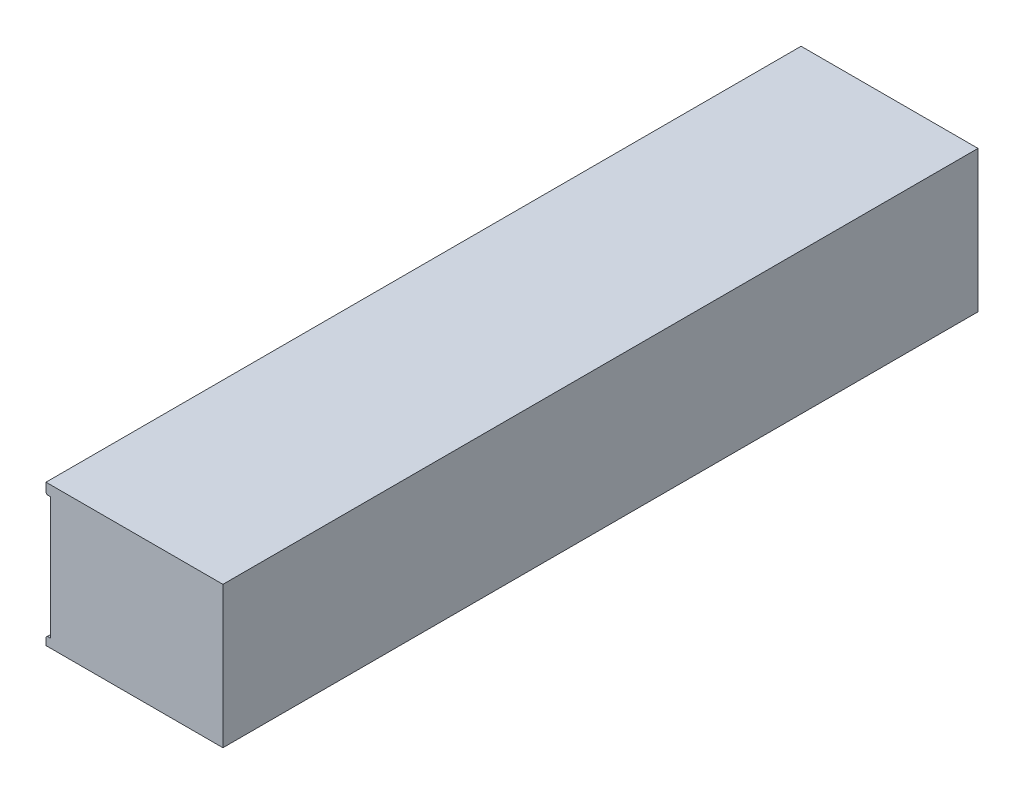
ISO-10303-21;
HEADER;
FILE_DESCRIPTION(('STEP AP214'),'2;1');
FILE_NAME('part.step','',(''),(''),'','','');
FILE_SCHEMA(('AUTOMOTIVE_DESIGN { 1 0 10303 214 1 1 1 1 }'));
ENDSEC;
DATA;
#1=APPLICATION_CONTEXT('core data for automotive mechanical design processes');
#2=APPLICATION_PROTOCOL_DEFINITION('international standard','automotive_design',2000,#1);
#3=PRODUCT_CONTEXT('',#1,'mechanical');
#4=PRODUCT('Part','Part','',(#3));
#5=PRODUCT_RELATED_PRODUCT_CATEGORY('part','',(#4));
#6=PRODUCT_DEFINITION_FORMATION('','',#4);
#7=PRODUCT_DEFINITION_CONTEXT('part definition',#1,'design');
#8=PRODUCT_DEFINITION('design','',#6,#7);
#9=PRODUCT_DEFINITION_SHAPE('','',#8);
#10=(LENGTH_UNIT() NAMED_UNIT(*) SI_UNIT(.MILLI.,.METRE.));
#11=(NAMED_UNIT(*) PLANE_ANGLE_UNIT() SI_UNIT($,.RADIAN.));
#12=(NAMED_UNIT(*) SI_UNIT($,.STERADIAN.) SOLID_ANGLE_UNIT());
#13=UNCERTAINTY_MEASURE_WITH_UNIT(LENGTH_MEASURE(1.E-05),#10,'distance_accuracy_value','');
#14=(GEOMETRIC_REPRESENTATION_CONTEXT(3) GLOBAL_UNCERTAINTY_ASSIGNED_CONTEXT((#13)) GLOBAL_UNIT_ASSIGNED_CONTEXT((#10,
#11,#12)) REPRESENTATION_CONTEXT('',''));
#15=CARTESIAN_POINT('',(0.,0.,0.));
#16=DIRECTION('',(0.,0.,1.));
#17=DIRECTION('',(1.,0.,0.));
#18=AXIS2_PLACEMENT_3D('',#15,#16,#17);
#19=CARTESIAN_POINT('',(-1.39699999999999,0.,111.1123));
#20=DIRECTION('',(0.,-1.,0.));
#21=DIRECTION('',(0.,0.,-1.));
#22=AXIS2_PLACEMENT_3D('',#19,#20,#21);
#23=PLANE('',#22);
#24=DIRECTION('',(-1.,0.,0.));
#25=VECTOR('',#24,1.);
#26=CARTESIAN_POINT('',(-1.39699999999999,0.,-111.1123));
#27=LINE('',#26,#25);
#28=CARTESIAN_POINT('',(50.673,0.,-111.1123));
#29=VERTEX_POINT('',#28);
#30=CARTESIAN_POINT('',(-1.39699999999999,0.,-111.1123));
#31=VERTEX_POINT('',#30);
#32=EDGE_CURVE('E360',#29,#31,#27,.T.);
#33=ORIENTED_EDGE('',*,*,#32,.T.);
#34=DIRECTION('',(0.,0.,-1.));
#35=VECTOR('',#34,1.);
#36=CARTESIAN_POINT('',(-1.39699999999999,0.,111.1123));
#37=LINE('',#36,#35);
#38=CARTESIAN_POINT('',(-1.39699999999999,0.,111.1123));
#39=VERTEX_POINT('',#38);
#40=EDGE_CURVE('E411',#39,#31,#37,.T.);
#41=ORIENTED_EDGE('',*,*,#40,.F.);
#42=DIRECTION('',(-1.,0.,0.));
#43=VECTOR('',#42,1.);
#44=CARTESIAN_POINT('',(-1.39699999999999,0.,111.1123));
#45=LINE('',#44,#43);
#46=CARTESIAN_POINT('',(50.673,0.,111.1123));
#47=VERTEX_POINT('',#46);
#48=EDGE_CURVE('E361',#47,#39,#45,.T.);
#49=ORIENTED_EDGE('',*,*,#48,.F.);
#50=DIRECTION('',(0.,0.,-1.));
#51=VECTOR('',#50,1.);
#52=CARTESIAN_POINT('',(50.673,0.,111.1123));
#53=LINE('',#52,#51);
#54=EDGE_CURVE('E380',#47,#29,#53,.T.);
#55=ORIENTED_EDGE('',*,*,#54,.T.);
#56=EDGE_LOOP('',(#33,#41,#49,#55));
#57=FACE_BOUND('',#56,.T.);
#58=ADVANCED_FACE('F37',(#57),#23,.F.);
#59=CARTESIAN_POINT('',(-1.39699999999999,-3.048,111.1123));
#60=DIRECTION('',(1.,0.,0.));
#61=DIRECTION('',(0.,0.,-1.));
#62=AXIS2_PLACEMENT_3D('',#59,#60,#61);
#63=PLANE('',#62);
#64=DIRECTION('',(0.,-1.,0.));
#65=VECTOR('',#64,1.);
#66=CARTESIAN_POINT('',(-1.39699999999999,-3.048,-111.1123));
#67=LINE('',#66,#65);
#68=CARTESIAN_POINT('',(-1.39699999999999,-2.66700000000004,-111.1123));
#69=VERTEX_POINT('',#68);
#70=EDGE_CURVE('E383',#31,#69,#67,.T.);
#71=ORIENTED_EDGE('',*,*,#70,.T.);
#72=DIRECTION('',(0.,0.,1.));
#73=VECTOR('',#72,1.);
#74=CARTESIAN_POINT('',(-1.39699999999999,-2.66700000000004,111.1123));
#75=LINE('',#74,#73);
#76=CARTESIAN_POINT('',(-1.39699999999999,-2.66700000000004,111.1123));
#77=VERTEX_POINT('',#76);
#78=EDGE_CURVE('E11',#69,#77,#75,.T.);
#79=ORIENTED_EDGE('',*,*,#78,.T.);
#80=DIRECTION('',(0.,-1.,0.));
#81=VECTOR('',#80,1.);
#82=CARTESIAN_POINT('',(-1.39699999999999,-3.048,111.1123));
#83=LINE('',#82,#81);
#84=EDGE_CURVE('E364',#39,#77,#83,.T.);
#85=ORIENTED_EDGE('',*,*,#84,.F.);
#86=ORIENTED_EDGE('',*,*,#40,.T.);
#87=EDGE_LOOP('',(#71,#79,#85,#86));
#88=FACE_BOUND('',#87,.T.);
#89=ADVANCED_FACE('F467',(#88),#63,.F.);
#90=CARTESIAN_POINT('',(0.,-3.048,111.1123));
#91=DIRECTION('',(0.,1.,0.));
#92=DIRECTION('',(0.,0.,1.));
#93=AXIS2_PLACEMENT_3D('',#90,#91,#92);
#94=PLANE('',#93);
#95=DIRECTION('',(1.,0.,0.));
#96=VECTOR('',#95,1.);
#97=CARTESIAN_POINT('',(0.,-3.048,111.1123));
#98=LINE('',#97,#96);
#99=CARTESIAN_POINT('',(-1.01600000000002,-3.048,111.1123));
#100=VERTEX_POINT('',#99);
#101=CARTESIAN_POINT('',(0.,-3.048,111.1123));
#102=VERTEX_POINT('',#101);
#103=EDGE_CURVE('E367',#100,#102,#98,.T.);
#104=ORIENTED_EDGE('',*,*,#103,.F.);
#105=DIRECTION('',(0.,0.,-1.));
#106=VECTOR('',#105,1.);
#107=CARTESIAN_POINT('',(-1.01600000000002,-3.048,111.1123));
#108=LINE('',#107,#106);
#109=CARTESIAN_POINT('',(-1.01600000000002,-3.048,-111.1123));
#110=VERTEX_POINT('',#109);
#111=EDGE_CURVE('E45',#100,#110,#108,.T.);
#112=ORIENTED_EDGE('',*,*,#111,.T.);
#113=DIRECTION('',(1.,0.,0.));
#114=VECTOR('',#113,1.);
#115=CARTESIAN_POINT('',(0.,-3.048,-111.1123));
#116=LINE('',#115,#114);
#117=CARTESIAN_POINT('',(0.,-3.048,-111.1123));
#118=VERTEX_POINT('',#117);
#119=EDGE_CURVE('E385',#110,#118,#116,.T.);
#120=ORIENTED_EDGE('',*,*,#119,.T.);
#121=DIRECTION('',(0.,0.,-1.));
#122=VECTOR('',#121,1.);
#123=CARTESIAN_POINT('',(0.,-3.048,111.1123));
#124=LINE('',#123,#122);
#125=EDGE_CURVE('E408',#102,#118,#124,.T.);
#126=ORIENTED_EDGE('',*,*,#125,.F.);
#127=EDGE_LOOP('',(#104,#112,#120,#126));
#128=FACE_BOUND('',#127,.T.);
#129=ADVANCED_FACE('F429',(#128),#94,.F.);
#130=CARTESIAN_POINT('',(0.,-39.116,111.1123));
#131=DIRECTION('',(1.,0.,0.));
#132=DIRECTION('',(0.,0.,-1.));
#133=AXIS2_PLACEMENT_3D('',#130,#131,#132);
#134=PLANE('',#133);
#135=CARTESIAN_POINT('',(0.,-6.35000000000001,-106.2482));
#136=DIRECTION('',(-1.,0.,0.));
#137=DIRECTION('',(0.,0.,1.));
#138=AXIS2_PLACEMENT_3D('',#135,#136,#137);
#139=CIRCLE('',#138,2.413);
#140=CARTESIAN_POINT('',(0.,-6.35000000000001,-103.8352));
#141=VERTEX_POINT('',#140);
#142=EDGE_CURVE('E177',#141,#141,#139,.T.);
#143=ORIENTED_EDGE('',*,*,#142,.F.);
#144=EDGE_LOOP('',(#143));
#145=FACE_BOUND('',#144,.T.);
#146=CARTESIAN_POINT('',(0.,-6.34999999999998,106.2482));
#147=DIRECTION('',(-1.,0.,0.));
#148=DIRECTION('',(0.,0.,1.));
#149=AXIS2_PLACEMENT_3D('',#146,#147,#148);
#150=CIRCLE('',#149,2.413);
#151=CARTESIAN_POINT('',(0.,-6.34999999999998,108.6612));
#152=VERTEX_POINT('',#151);
#153=EDGE_CURVE('E189',#152,#152,#150,.T.);
#154=ORIENTED_EDGE('',*,*,#153,.F.);
#155=EDGE_LOOP('',(#154));
#156=FACE_BOUND('',#155,.T.);
#157=CARTESIAN_POINT('',(0.,-6.34999999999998,4.8768));
#158=DIRECTION('',(-1.,0.,0.));
#159=DIRECTION('',(0.,0.,1.));
#160=AXIS2_PLACEMENT_3D('',#157,#158,#159);
#161=CIRCLE('',#160,2.413);
#162=CARTESIAN_POINT('',(0.,-6.34999999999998,7.2898));
#163=VERTEX_POINT('',#162);
#164=EDGE_CURVE('E201',#163,#163,#161,.T.);
#165=ORIENTED_EDGE('',*,*,#164,.F.);
#166=EDGE_LOOP('',(#165));
#167=FACE_BOUND('',#166,.T.);
#168=CARTESIAN_POINT('',(0.,-6.34999999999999,-4.8768));
#169=DIRECTION('',(-1.,0.,0.));
#170=DIRECTION('',(0.,0.,1.));
#171=AXIS2_PLACEMENT_3D('',#168,#169,#170);
#172=CIRCLE('',#171,2.413);
#173=CARTESIAN_POINT('',(0.,-6.34999999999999,-2.4638));
#174=VERTEX_POINT('',#173);
#175=EDGE_CURVE('E213',#174,#174,#172,.T.);
#176=ORIENTED_EDGE('',*,*,#175,.F.);
#177=EDGE_LOOP('',(#176));
#178=FACE_BOUND('',#177,.T.);
#179=CARTESIAN_POINT('',(0.,-35.814,-106.2482));
#180=DIRECTION('',(-1.,0.,0.));
#181=DIRECTION('',(0.,0.,1.));
#182=AXIS2_PLACEMENT_3D('',#179,#180,#181);
#183=CIRCLE('',#182,2.413);
#184=CARTESIAN_POINT('',(0.,-35.814,-103.8352));
#185=VERTEX_POINT('',#184);
#186=EDGE_CURVE('E225',#185,#185,#183,.T.);
#187=ORIENTED_EDGE('',*,*,#186,.F.);
#188=EDGE_LOOP('',(#187));
#189=FACE_BOUND('',#188,.T.);
#190=CARTESIAN_POINT('',(0.,-35.814,-4.87679999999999));
#191=DIRECTION('',(-1.,0.,0.));
#192=DIRECTION('',(0.,0.,1.));
#193=AXIS2_PLACEMENT_3D('',#190,#191,#192);
#194=CIRCLE('',#193,2.413);
#195=CARTESIAN_POINT('',(0.,-35.814,-2.46379999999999));
#196=VERTEX_POINT('',#195);
#197=EDGE_CURVE('E237',#196,#196,#194,.T.);
#198=ORIENTED_EDGE('',*,*,#197,.F.);
#199=EDGE_LOOP('',(#198));
#200=FACE_BOUND('',#199,.T.);
#201=CARTESIAN_POINT('',(0.,-35.814,4.8768));
#202=DIRECTION('',(-1.,0.,0.));
#203=DIRECTION('',(0.,0.,1.));
#204=AXIS2_PLACEMENT_3D('',#201,#202,#203);
#205=CIRCLE('',#204,2.413);
#206=CARTESIAN_POINT('',(0.,-35.814,7.2898));
#207=VERTEX_POINT('',#206);
#208=EDGE_CURVE('E249',#207,#207,#205,.T.);
#209=ORIENTED_EDGE('',*,*,#208,.F.);
#210=EDGE_LOOP('',(#209));
#211=FACE_BOUND('',#210,.T.);
#212=CARTESIAN_POINT('',(0.,-35.814,106.2482));
#213=DIRECTION('',(-1.,0.,0.));
#214=DIRECTION('',(0.,0.,1.));
#215=AXIS2_PLACEMENT_3D('',#212,#213,#214);
#216=CIRCLE('',#215,2.413);
#217=CARTESIAN_POINT('',(0.,-35.814,108.6612));
#218=VERTEX_POINT('',#217);
#219=EDGE_CURVE('E261',#218,#218,#216,.T.);
#220=ORIENTED_EDGE('',*,*,#219,.F.);
#221=EDGE_LOOP('',(#220));
#222=FACE_BOUND('',#221,.T.);
#223=CARTESIAN_POINT('',(0.,-6.35,-60.4266));
#224=DIRECTION('',(-1.,0.,0.));
#225=DIRECTION('',(0.,0.,1.));
#226=AXIS2_PLACEMENT_3D('',#223,#224,#225);
#227=CIRCLE('',#226,2.413);
#228=CARTESIAN_POINT('',(0.,-6.35,-58.0136));
#229=VERTEX_POINT('',#228);
#230=EDGE_CURVE('E273',#229,#229,#227,.T.);
#231=ORIENTED_EDGE('',*,*,#230,.F.);
#232=EDGE_LOOP('',(#231));
#233=FACE_BOUND('',#232,.T.);
#234=CARTESIAN_POINT('',(0.,-6.35,-50.673));
#235=DIRECTION('',(-1.,0.,0.));
#236=DIRECTION('',(0.,0.,1.));
#237=AXIS2_PLACEMENT_3D('',#234,#235,#236);
#238=CIRCLE('',#237,2.413);
#239=CARTESIAN_POINT('',(0.,-6.35,-48.26));
#240=VERTEX_POINT('',#239);
#241=EDGE_CURVE('E285',#240,#240,#238,.T.);
#242=ORIENTED_EDGE('',*,*,#241,.F.);
#243=EDGE_LOOP('',(#242));
#244=FACE_BOUND('',#243,.T.);
#245=CARTESIAN_POINT('',(0.,-35.814,-50.673));
#246=DIRECTION('',(-1.,0.,0.));
#247=DIRECTION('',(0.,0.,1.));
#248=AXIS2_PLACEMENT_3D('',#245,#246,#247);
#249=CIRCLE('',#248,2.413);
#250=CARTESIAN_POINT('',(0.,-35.814,-48.26));
#251=VERTEX_POINT('',#250);
#252=EDGE_CURVE('E297',#251,#251,#249,.T.);
#253=ORIENTED_EDGE('',*,*,#252,.F.);
#254=EDGE_LOOP('',(#253));
#255=FACE_BOUND('',#254,.T.);
#256=CARTESIAN_POINT('',(0.,-35.814,-60.4266));
#257=DIRECTION('',(-1.,0.,0.));
#258=DIRECTION('',(0.,0.,1.));
#259=AXIS2_PLACEMENT_3D('',#256,#257,#258);
#260=CIRCLE('',#259,2.413);
#261=CARTESIAN_POINT('',(0.,-35.814,-58.0136));
#262=VERTEX_POINT('',#261);
#263=EDGE_CURVE('E309',#262,#262,#260,.T.);
#264=ORIENTED_EDGE('',*,*,#263,.F.);
#265=EDGE_LOOP('',(#264));
#266=FACE_BOUND('',#265,.T.);
#267=CARTESIAN_POINT('',(0.,-6.34999999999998,50.673));
#268=DIRECTION('',(-1.,0.,0.));
#269=DIRECTION('',(0.,0.,1.));
#270=AXIS2_PLACEMENT_3D('',#267,#268,#269);
#271=CIRCLE('',#270,2.413);
#272=CARTESIAN_POINT('',(0.,-6.34999999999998,53.086));
#273=VERTEX_POINT('',#272);
#274=EDGE_CURVE('E321',#273,#273,#271,.T.);
#275=ORIENTED_EDGE('',*,*,#274,.F.);
#276=EDGE_LOOP('',(#275));
#277=FACE_BOUND('',#276,.T.);
#278=CARTESIAN_POINT('',(0.,-6.34999999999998,60.4266));
#279=DIRECTION('',(-1.,0.,0.));
#280=DIRECTION('',(0.,0.,1.));
#281=AXIS2_PLACEMENT_3D('',#278,#279,#280);
#282=CIRCLE('',#281,2.413);
#283=CARTESIAN_POINT('',(0.,-6.34999999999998,62.8396));
#284=VERTEX_POINT('',#283);
#285=EDGE_CURVE('E333',#284,#284,#282,.T.);
#286=ORIENTED_EDGE('',*,*,#285,.F.);
#287=EDGE_LOOP('',(#286));
#288=FACE_BOUND('',#287,.T.);
#289=CARTESIAN_POINT('',(0.,-35.814,60.4266));
#290=DIRECTION('',(-1.,0.,0.));
#291=DIRECTION('',(0.,0.,1.));
#292=AXIS2_PLACEMENT_3D('',#289,#290,#291);
#293=CIRCLE('',#292,2.413);
#294=CARTESIAN_POINT('',(0.,-35.814,62.8396));
#295=VERTEX_POINT('',#294);
#296=EDGE_CURVE('E345',#295,#295,#293,.T.);
#297=ORIENTED_EDGE('',*,*,#296,.F.);
#298=EDGE_LOOP('',(#297));
#299=FACE_BOUND('',#298,.T.);
#300=CARTESIAN_POINT('',(0.,-35.814,50.673));
#301=DIRECTION('',(-1.,0.,0.));
#302=DIRECTION('',(0.,0.,1.));
#303=AXIS2_PLACEMENT_3D('',#300,#301,#302);
#304=CIRCLE('',#303,2.413);
#305=CARTESIAN_POINT('',(0.,-35.814,53.086));
#306=VERTEX_POINT('',#305);
#307=EDGE_CURVE('E357',#306,#306,#304,.T.);
#308=ORIENTED_EDGE('',*,*,#307,.F.);
#309=EDGE_LOOP('',(#308));
#310=FACE_BOUND('',#309,.T.);
#311=DIRECTION('',(0.,-1.,0.));
#312=VECTOR('',#311,1.);
#313=CARTESIAN_POINT('',(0.,-39.116,-111.1123));
#314=LINE('',#313,#312);
#315=CARTESIAN_POINT('',(0.,-39.116,-111.1123));
#316=VERTEX_POINT('',#315);
#317=EDGE_CURVE('E387',#118,#316,#314,.T.);
#318=ORIENTED_EDGE('',*,*,#317,.T.);
#319=DIRECTION('',(0.,0.,-1.));
#320=VECTOR('',#319,1.);
#321=CARTESIAN_POINT('',(0.,-39.116,111.1123));
#322=LINE('',#321,#320);
#323=CARTESIAN_POINT('',(0.,-39.116,111.1123));
#324=VERTEX_POINT('',#323);
#325=EDGE_CURVE('E405',#324,#316,#322,.T.);
#326=ORIENTED_EDGE('',*,*,#325,.F.);
#327=DIRECTION('',(0.,-1.,0.));
#328=VECTOR('',#327,1.);
#329=CARTESIAN_POINT('',(0.,-39.116,111.1123));
#330=LINE('',#329,#328);
#331=EDGE_CURVE('E369',#102,#324,#330,.T.);
#332=ORIENTED_EDGE('',*,*,#331,.F.);
#333=ORIENTED_EDGE('',*,*,#125,.T.);
#334=EDGE_LOOP('',(#318,#326,#332,#333));
#335=FACE_BOUND('',#334,.T.);
#336=ADVANCED_FACE('F439',(#145,#156,#167,#178,#189,#200,#211,#222,#233,#244,#255,#266,#277,
#288,#299,#310,#335),#134,.F.);
#337=CARTESIAN_POINT('',(-1.39699999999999,-39.116,111.1123));
#338=DIRECTION('',(0.,-1.,0.));
#339=DIRECTION('',(0.,0.,-1.));
#340=AXIS2_PLACEMENT_3D('',#337,#338,#339);
#341=PLANE('',#340);
#342=DIRECTION('',(-1.,0.,0.));
#343=VECTOR('',#342,1.);
#344=CARTESIAN_POINT('',(-1.39699999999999,-39.116,-111.1123));
#345=LINE('',#344,#343);
#346=CARTESIAN_POINT('',(-1.016,-39.116,-111.1123));
#347=VERTEX_POINT('',#346);
#348=EDGE_CURVE('E389',#316,#347,#345,.T.);
#349=ORIENTED_EDGE('',*,*,#348,.T.);
#350=DIRECTION('',(0.,0.,1.));
#351=VECTOR('',#350,1.);
#352=CARTESIAN_POINT('',(-1.016,-39.116,111.1123));
#353=LINE('',#352,#351);
#354=CARTESIAN_POINT('',(-1.016,-39.116,111.1123));
#355=VERTEX_POINT('',#354);
#356=EDGE_CURVE('E421',#347,#355,#353,.T.);
#357=ORIENTED_EDGE('',*,*,#356,.T.);
#358=DIRECTION('',(-1.,0.,0.));
#359=VECTOR('',#358,1.);
#360=CARTESIAN_POINT('',(-1.39699999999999,-39.116,111.1123));
#361=LINE('',#360,#359);
#362=EDGE_CURVE('E371',#324,#355,#361,.T.);
#363=ORIENTED_EDGE('',*,*,#362,.F.);
#364=ORIENTED_EDGE('',*,*,#325,.T.);
#365=EDGE_LOOP('',(#349,#357,#363,#364));
#366=FACE_BOUND('',#365,.T.);
#367=ADVANCED_FACE('F443',(#366),#341,.F.);
#368=CARTESIAN_POINT('',(-1.39699999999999,-41.656,111.1123));
#369=DIRECTION('',(1.,0.,0.));
#370=DIRECTION('',(0.,0.,-1.));
#371=AXIS2_PLACEMENT_3D('',#368,#369,#370);
#372=PLANE('',#371);
#373=DIRECTION('',(0.,-1.,0.));
#374=VECTOR('',#373,1.);
#375=CARTESIAN_POINT('',(-1.39699999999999,-41.656,111.1123));
#376=LINE('',#375,#374);
#377=CARTESIAN_POINT('',(-1.39699999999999,-39.497,111.1123));
#378=VERTEX_POINT('',#377);
#379=CARTESIAN_POINT('',(-1.39699999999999,-41.656,111.1123));
#380=VERTEX_POINT('',#379);
#381=EDGE_CURVE('E374',#378,#380,#376,.T.);
#382=ORIENTED_EDGE('',*,*,#381,.F.);
#383=DIRECTION('',(0.,0.,-1.));
#384=VECTOR('',#383,1.);
#385=CARTESIAN_POINT('',(-1.39699999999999,-39.497,111.1123));
#386=LINE('',#385,#384);
#387=CARTESIAN_POINT('',(-1.39699999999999,-39.497,-111.1123));
#388=VERTEX_POINT('',#387);
#389=EDGE_CURVE('E414',#378,#388,#386,.T.);
#390=ORIENTED_EDGE('',*,*,#389,.T.);
#391=DIRECTION('',(0.,-1.,0.));
#392=VECTOR('',#391,1.);
#393=CARTESIAN_POINT('',(-1.39699999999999,-41.656,-111.1123));
#394=LINE('',#393,#392);
#395=CARTESIAN_POINT('',(-1.39699999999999,-41.656,-111.1123));
#396=VERTEX_POINT('',#395);
#397=EDGE_CURVE('E392',#388,#396,#394,.T.);
#398=ORIENTED_EDGE('',*,*,#397,.T.);
#399=DIRECTION('',(0.,0.,-1.));
#400=VECTOR('',#399,1.);
#401=CARTESIAN_POINT('',(-1.39699999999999,-41.656,111.1123));
#402=LINE('',#401,#400);
#403=EDGE_CURVE('E402',#380,#396,#402,.T.);
#404=ORIENTED_EDGE('',*,*,#403,.F.);
#405=EDGE_LOOP('',(#382,#390,#398,#404));
#406=FACE_BOUND('',#405,.T.);
#407=ADVANCED_FACE('F451',(#406),#372,.F.);
#408=CARTESIAN_POINT('',(50.673,-41.656,111.1123));
#409=DIRECTION('',(0.,1.,0.));
#410=DIRECTION('',(-1.,0.,0.));
#411=AXIS2_PLACEMENT_3D('',#408,#409,#410);
#412=PLANE('',#411);
#413=DIRECTION('',(1.,0.,0.));
#414=VECTOR('',#413,1.);
#415=CARTESIAN_POINT('',(50.673,-41.656,-111.1123));
#416=LINE('',#415,#414);
#417=CARTESIAN_POINT('',(50.673,-41.656,-111.1123));
#418=VERTEX_POINT('',#417);
#419=EDGE_CURVE('E394',#396,#418,#416,.T.);
#420=ORIENTED_EDGE('',*,*,#419,.T.);
#421=DIRECTION('',(0.,0.,-1.));
#422=VECTOR('',#421,1.);
#423=CARTESIAN_POINT('',(50.673,-41.656,111.1123));
#424=LINE('',#423,#422);
#425=CARTESIAN_POINT('',(50.673,-41.656,111.1123));
#426=VERTEX_POINT('',#425);
#427=EDGE_CURVE('E399',#426,#418,#424,.T.);
#428=ORIENTED_EDGE('',*,*,#427,.F.);
#429=DIRECTION('',(1.,0.,0.));
#430=VECTOR('',#429,1.);
#431=CARTESIAN_POINT('',(50.673,-41.656,111.1123));
#432=LINE('',#431,#430);
#433=EDGE_CURVE('E376',#380,#426,#432,.T.);
#434=ORIENTED_EDGE('',*,*,#433,.F.);
#435=ORIENTED_EDGE('',*,*,#403,.T.);
#436=EDGE_LOOP('',(#420,#428,#434,#435));
#437=FACE_BOUND('',#436,.T.);
#438=ADVANCED_FACE('F458',(#437),#412,.F.);
#439=CARTESIAN_POINT('',(50.673,0.,111.1123));
#440=DIRECTION('',(-1.,0.,0.));
#441=DIRECTION('',(0.,-1.,0.));
#442=AXIS2_PLACEMENT_3D('',#439,#440,#441);
#443=PLANE('',#442);
#444=DIRECTION('',(0.,1.,0.));
#445=VECTOR('',#444,1.);
#446=CARTESIAN_POINT('',(50.673,0.,-111.1123));
#447=LINE('',#446,#445);
#448=EDGE_CURVE('E365',#418,#29,#447,.T.);
#449=ORIENTED_EDGE('',*,*,#448,.T.);
#450=ORIENTED_EDGE('',*,*,#54,.F.);
#451=DIRECTION('',(0.,1.,0.));
#452=VECTOR('',#451,1.);
#453=CARTESIAN_POINT('',(50.673,0.,111.1123));
#454=LINE('',#453,#452);
#455=EDGE_CURVE('E378',#426,#47,#454,.T.);
#456=ORIENTED_EDGE('',*,*,#455,.F.);
#457=ORIENTED_EDGE('',*,*,#427,.T.);
#458=EDGE_LOOP('',(#449,#450,#456,#457));
#459=FACE_BOUND('',#458,.T.);
#460=ADVANCED_FACE('F462',(#459),#443,.F.);
#461=CARTESIAN_POINT('',(-1.39699999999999,0.,111.1123));
#462=DIRECTION('',(0.,0.,1.));
#463=DIRECTION('',(1.,0.,0.));
#464=AXIS2_PLACEMENT_3D('',#461,#462,#463);
#465=PLANE('',#464);
#466=ORIENTED_EDGE('',*,*,#362,.T.);
#467=DIRECTION('',(0.707106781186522,0.707106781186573,0.));
#468=VECTOR('',#467,1.);
#469=CARTESIAN_POINT('',(18.3515,-19.7484999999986,111.1123));
#470=LINE('',#469,#468);
#471=EDGE_CURVE('E424',#355,#378,#470,.F.);
#472=ORIENTED_EDGE('',*,*,#471,.T.);
#473=ORIENTED_EDGE('',*,*,#381,.T.);
#474=ORIENTED_EDGE('',*,*,#433,.T.);
#475=ORIENTED_EDGE('',*,*,#455,.T.);
#476=ORIENTED_EDGE('',*,*,#48,.T.);
#477=ORIENTED_EDGE('',*,*,#84,.T.);
#478=DIRECTION('',(-0.707106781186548,0.707106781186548,0.));
#479=VECTOR('',#478,1.);
#480=CARTESIAN_POINT('',(-2.73050000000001,-1.33350000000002,111.1123));
#481=LINE('',#480,#479);
#482=EDGE_CURVE('E52',#77,#100,#481,.F.);
#483=ORIENTED_EDGE('',*,*,#482,.T.);
#484=ORIENTED_EDGE('',*,*,#103,.T.);
#485=ORIENTED_EDGE('',*,*,#331,.T.);
#486=EDGE_LOOP('',(#466,#472,#473,#474,#475,#476,#477,#483,#484,#485));
#487=FACE_BOUND('',#486,.T.);
#488=ADVANCED_FACE('F446',(#487),#465,.T.);
#489=CARTESIAN_POINT('',(-1.39699999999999,0.,-111.1123));
#490=DIRECTION('',(0.,0.,1.));
#491=DIRECTION('',(1.,0.,0.));
#492=AXIS2_PLACEMENT_3D('',#489,#490,#491);
#493=PLANE('',#492);
#494=ORIENTED_EDGE('',*,*,#397,.F.);
#495=DIRECTION('',(-0.707106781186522,-0.707106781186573,0.));
#496=VECTOR('',#495,1.);
#497=CARTESIAN_POINT('',(-1.39699999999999,-39.497,-111.1123));
#498=LINE('',#497,#496);
#499=EDGE_CURVE('E419',#388,#347,#498,.F.);
#500=ORIENTED_EDGE('',*,*,#499,.T.);
#501=ORIENTED_EDGE('',*,*,#348,.F.);
#502=ORIENTED_EDGE('',*,*,#317,.F.);
#503=ORIENTED_EDGE('',*,*,#119,.F.);
#504=DIRECTION('',(0.707106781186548,-0.707106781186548,0.));
#505=VECTOR('',#504,1.);
#506=CARTESIAN_POINT('',(-1.01600000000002,-3.048,-111.1123));
#507=LINE('',#506,#505);
#508=EDGE_CURVE('E417',#110,#69,#507,.F.);
#509=ORIENTED_EDGE('',*,*,#508,.T.);
#510=ORIENTED_EDGE('',*,*,#70,.F.);
#511=ORIENTED_EDGE('',*,*,#32,.F.);
#512=ORIENTED_EDGE('',*,*,#448,.F.);
#513=ORIENTED_EDGE('',*,*,#419,.F.);
#514=EDGE_LOOP('',(#494,#500,#501,#502,#503,#509,#510,#511,#512,#513));
#515=FACE_BOUND('',#514,.T.);
#516=ADVANCED_FACE('F435',(#515),#493,.F.);
#517=CARTESIAN_POINT('',(0.,-35.814,50.673));
#518=DIRECTION('',(-1.,0.,0.));
#519=DIRECTION('',(0.,0.,1.));
#520=AXIS2_PLACEMENT_3D('',#517,#518,#519);
#521=CYLINDRICAL_SURFACE('',#520,2.413);
#522=CARTESIAN_POINT('',(7.62,-35.814,50.673));
#523=DIRECTION('',(-1.,0.,0.));
#524=DIRECTION('',(0.,0.,1.));
#525=AXIS2_PLACEMENT_3D('',#522,#523,#524);
#526=CIRCLE('',#525,2.413);
#527=CARTESIAN_POINT('',(7.62,-35.814,53.086));
#528=VERTEX_POINT('',#527);
#529=EDGE_CURVE('E354',#528,#528,#526,.T.);
#530=ORIENTED_EDGE('',*,*,#529,.F.);
#531=EDGE_LOOP('',(#530));
#532=FACE_BOUND('',#531,.T.);
#533=ORIENTED_EDGE('',*,*,#307,.T.);
#534=EDGE_LOOP('',(#533));
#535=FACE_BOUND('',#534,.T.);
#536=ADVANCED_FACE('F494',(#532,#535),#521,.F.);
#537=CARTESIAN_POINT('',(7.62,-33.7947,50.673));
#538=DIRECTION('',(1.,0.,0.));
#539=DIRECTION('',(0.,0.,-1.));
#540=AXIS2_PLACEMENT_3D('',#537,#538,#539);
#541=PLANE('',#540);
#542=CARTESIAN_POINT('',(7.62,-35.814,50.673));
#543=DIRECTION('',(-1.,0.,0.));
#544=DIRECTION('',(0.,0.,1.));
#545=AXIS2_PLACEMENT_3D('',#542,#543,#544);
#546=CIRCLE('',#545,2.0193);
#547=CARTESIAN_POINT('',(7.62,-35.814,52.6923));
#548=VERTEX_POINT('',#547);
#549=EDGE_CURVE('E351',#548,#548,#546,.T.);
#550=ORIENTED_EDGE('',*,*,#549,.F.);
#551=EDGE_LOOP('',(#550));
#552=FACE_BOUND('',#551,.T.);
#553=ORIENTED_EDGE('',*,*,#529,.T.);
#554=EDGE_LOOP('',(#553));
#555=FACE_BOUND('',#554,.T.);
#556=ADVANCED_FACE('F499',(#552,#555),#541,.F.);
#557=CARTESIAN_POINT('',(0.,-35.814,50.673));
#558=DIRECTION('',(-1.,0.,0.));
#559=DIRECTION('',(0.,0.,1.));
#560=AXIS2_PLACEMENT_3D('',#557,#558,#559);
#561=CYLINDRICAL_SURFACE('',#560,2.0193);
#562=CARTESIAN_POINT('',(9.99744,-35.814,50.673));
#563=DIRECTION('',(-1.,0.,0.));
#564=DIRECTION('',(0.,0.,1.));
#565=AXIS2_PLACEMENT_3D('',#562,#563,#564);
#566=CIRCLE('',#565,2.01929999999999);
#567=CARTESIAN_POINT('',(9.99744,-35.814,52.6923));
#568=VERTEX_POINT('',#567);
#569=EDGE_CURVE('E348',#568,#568,#566,.T.);
#570=ORIENTED_EDGE('',*,*,#569,.F.);
#571=EDGE_LOOP('',(#570));
#572=FACE_BOUND('',#571,.T.);
#573=ORIENTED_EDGE('',*,*,#549,.T.);
#574=EDGE_LOOP('',(#573));
#575=FACE_BOUND('',#574,.T.);
#576=ADVANCED_FACE('F503',(#572,#575),#561,.F.);
#577=CARTESIAN_POINT('',(9.99744,-35.814,50.673));
#578=DIRECTION('',(-1.,0.,0.));
#579=DIRECTION('',(0.,0.,1.));
#580=AXIS2_PLACEMENT_3D('',#577,#578,#579);
#581=CONICAL_SURFACE('',#580,2.01929999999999,1.02974425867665);
#582=CARTESIAN_POINT('',(11.2107578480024,-35.814,50.673));
#583=VERTEX_POINT('',#582);
#584=VERTEX_LOOP('',#583);
#585=FACE_BOUND('',#584,.T.);
#586=ORIENTED_EDGE('',*,*,#569,.T.);
#587=EDGE_LOOP('',(#586));
#588=FACE_BOUND('',#587,.T.);
#589=ADVANCED_FACE('F507',(#585,#588),#581,.F.);
#590=CARTESIAN_POINT('',(0.,-35.814,60.4266));
#591=DIRECTION('',(-1.,0.,0.));
#592=DIRECTION('',(0.,0.,1.));
#593=AXIS2_PLACEMENT_3D('',#590,#591,#592);
#594=CYLINDRICAL_SURFACE('',#593,2.413);
#595=CARTESIAN_POINT('',(7.62,-35.814,60.4266));
#596=DIRECTION('',(-1.,0.,0.));
#597=DIRECTION('',(0.,0.,1.));
#598=AXIS2_PLACEMENT_3D('',#595,#596,#597);
#599=CIRCLE('',#598,2.413);
#600=CARTESIAN_POINT('',(7.62,-35.814,62.8396));
#601=VERTEX_POINT('',#600);
#602=EDGE_CURVE('E342',#601,#601,#599,.T.);
#603=ORIENTED_EDGE('',*,*,#602,.F.);
#604=EDGE_LOOP('',(#603));
#605=FACE_BOUND('',#604,.T.);
#606=ORIENTED_EDGE('',*,*,#296,.T.);
#607=EDGE_LOOP('',(#606));
#608=FACE_BOUND('',#607,.T.);
#609=ADVANCED_FACE('F511',(#605,#608),#594,.F.);
#610=CARTESIAN_POINT('',(7.62,-33.7947,60.4266));
#611=DIRECTION('',(1.,0.,0.));
#612=DIRECTION('',(0.,0.,-1.));
#613=AXIS2_PLACEMENT_3D('',#610,#611,#612);
#614=PLANE('',#613);
#615=CARTESIAN_POINT('',(7.62,-35.814,60.4266));
#616=DIRECTION('',(-1.,0.,0.));
#617=DIRECTION('',(0.,0.,1.));
#618=AXIS2_PLACEMENT_3D('',#615,#616,#617);
#619=CIRCLE('',#618,2.0193);
#620=CARTESIAN_POINT('',(7.62,-35.814,62.4459));
#621=VERTEX_POINT('',#620);
#622=EDGE_CURVE('E339',#621,#621,#619,.T.);
#623=ORIENTED_EDGE('',*,*,#622,.F.);
#624=EDGE_LOOP('',(#623));
#625=FACE_BOUND('',#624,.T.);
#626=ORIENTED_EDGE('',*,*,#602,.T.);
#627=EDGE_LOOP('',(#626));
#628=FACE_BOUND('',#627,.T.);
#629=ADVANCED_FACE('F515',(#625,#628),#614,.F.);
#630=CARTESIAN_POINT('',(0.,-35.814,60.4266));
#631=DIRECTION('',(-1.,0.,0.));
#632=DIRECTION('',(0.,0.,1.));
#633=AXIS2_PLACEMENT_3D('',#630,#631,#632);
#634=CYLINDRICAL_SURFACE('',#633,2.0193);
#635=CARTESIAN_POINT('',(9.99744,-35.814,60.4266));
#636=DIRECTION('',(-1.,0.,0.));
#637=DIRECTION('',(0.,0.,1.));
#638=AXIS2_PLACEMENT_3D('',#635,#636,#637);
#639=CIRCLE('',#638,2.01929999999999);
#640=CARTESIAN_POINT('',(9.99744,-35.814,62.4459));
#641=VERTEX_POINT('',#640);
#642=EDGE_CURVE('E336',#641,#641,#639,.T.);
#643=ORIENTED_EDGE('',*,*,#642,.F.);
#644=EDGE_LOOP('',(#643));
#645=FACE_BOUND('',#644,.T.);
#646=ORIENTED_EDGE('',*,*,#622,.T.);
#647=EDGE_LOOP('',(#646));
#648=FACE_BOUND('',#647,.T.);
#649=ADVANCED_FACE('F519',(#645,#648),#634,.F.);
#650=CARTESIAN_POINT('',(9.99744,-35.814,60.4266));
#651=DIRECTION('',(-1.,0.,0.));
#652=DIRECTION('',(0.,0.,1.));
#653=AXIS2_PLACEMENT_3D('',#650,#651,#652);
#654=CONICAL_SURFACE('',#653,2.01929999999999,1.02974425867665);
#655=CARTESIAN_POINT('',(11.2107578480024,-35.814,60.4266));
#656=VERTEX_POINT('',#655);
#657=VERTEX_LOOP('',#656);
#658=FACE_BOUND('',#657,.T.);
#659=ORIENTED_EDGE('',*,*,#642,.T.);
#660=EDGE_LOOP('',(#659));
#661=FACE_BOUND('',#660,.T.);
#662=ADVANCED_FACE('F523',(#658,#661),#654,.F.);
#663=CARTESIAN_POINT('',(0.,-6.34999999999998,60.4266));
#664=DIRECTION('',(-1.,0.,0.));
#665=DIRECTION('',(0.,0.,1.));
#666=AXIS2_PLACEMENT_3D('',#663,#664,#665);
#667=CYLINDRICAL_SURFACE('',#666,2.413);
#668=CARTESIAN_POINT('',(7.62,-6.34999999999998,60.4266));
#669=DIRECTION('',(-1.,0.,0.));
#670=DIRECTION('',(0.,0.,1.));
#671=AXIS2_PLACEMENT_3D('',#668,#669,#670);
#672=CIRCLE('',#671,2.413);
#673=CARTESIAN_POINT('',(7.62,-6.34999999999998,62.8396));
#674=VERTEX_POINT('',#673);
#675=EDGE_CURVE('E330',#674,#674,#672,.T.);
#676=ORIENTED_EDGE('',*,*,#675,.F.);
#677=EDGE_LOOP('',(#676));
#678=FACE_BOUND('',#677,.T.);
#679=ORIENTED_EDGE('',*,*,#285,.T.);
#680=EDGE_LOOP('',(#679));
#681=FACE_BOUND('',#680,.T.);
#682=ADVANCED_FACE('F527',(#678,#681),#667,.F.);
#683=CARTESIAN_POINT('',(7.62,-4.33069999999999,60.4266));
#684=DIRECTION('',(1.,0.,0.));
#685=DIRECTION('',(0.,0.,-1.));
#686=AXIS2_PLACEMENT_3D('',#683,#684,#685);
#687=PLANE('',#686);
#688=CARTESIAN_POINT('',(7.62,-6.34999999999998,60.4266));
#689=DIRECTION('',(-1.,0.,0.));
#690=DIRECTION('',(0.,0.,1.));
#691=AXIS2_PLACEMENT_3D('',#688,#689,#690);
#692=CIRCLE('',#691,2.0193);
#693=CARTESIAN_POINT('',(7.62,-6.34999999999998,62.4459));
#694=VERTEX_POINT('',#693);
#695=EDGE_CURVE('E327',#694,#694,#692,.T.);
#696=ORIENTED_EDGE('',*,*,#695,.F.);
#697=EDGE_LOOP('',(#696));
#698=FACE_BOUND('',#697,.T.);
#699=ORIENTED_EDGE('',*,*,#675,.T.);
#700=EDGE_LOOP('',(#699));
#701=FACE_BOUND('',#700,.T.);
#702=ADVANCED_FACE('F531',(#698,#701),#687,.F.);
#703=CARTESIAN_POINT('',(0.,-6.34999999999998,60.4266));
#704=DIRECTION('',(-1.,0.,0.));
#705=DIRECTION('',(0.,0.,1.));
#706=AXIS2_PLACEMENT_3D('',#703,#704,#705);
#707=CYLINDRICAL_SURFACE('',#706,2.0193);
#708=CARTESIAN_POINT('',(9.99744,-6.34999999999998,60.4266));
#709=DIRECTION('',(-1.,0.,0.));
#710=DIRECTION('',(0.,0.,1.));
#711=AXIS2_PLACEMENT_3D('',#708,#709,#710);
#712=CIRCLE('',#711,2.0193);
#713=CARTESIAN_POINT('',(9.99744,-6.34999999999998,62.4459));
#714=VERTEX_POINT('',#713);
#715=EDGE_CURVE('E324',#714,#714,#712,.T.);
#716=ORIENTED_EDGE('',*,*,#715,.F.);
#717=EDGE_LOOP('',(#716));
#718=FACE_BOUND('',#717,.T.);
#719=ORIENTED_EDGE('',*,*,#695,.T.);
#720=EDGE_LOOP('',(#719));
#721=FACE_BOUND('',#720,.T.);
#722=ADVANCED_FACE('F535',(#718,#721),#707,.F.);
#723=CARTESIAN_POINT('',(9.99744,-6.34999999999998,60.4266));
#724=DIRECTION('',(-1.,0.,0.));
#725=DIRECTION('',(0.,0.,1.));
#726=AXIS2_PLACEMENT_3D('',#723,#724,#725);
#727=CONICAL_SURFACE('',#726,2.0193,1.02974425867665);
#728=CARTESIAN_POINT('',(11.2107578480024,-6.34999999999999,60.4266));
#729=VERTEX_POINT('',#728);
#730=VERTEX_LOOP('',#729);
#731=FACE_BOUND('',#730,.T.);
#732=ORIENTED_EDGE('',*,*,#715,.T.);
#733=EDGE_LOOP('',(#732));
#734=FACE_BOUND('',#733,.T.);
#735=ADVANCED_FACE('F539',(#731,#734),#727,.F.);
#736=CARTESIAN_POINT('',(0.,-6.34999999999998,50.673));
#737=DIRECTION('',(-1.,0.,0.));
#738=DIRECTION('',(0.,0.,1.));
#739=AXIS2_PLACEMENT_3D('',#736,#737,#738);
#740=CYLINDRICAL_SURFACE('',#739,2.413);
#741=CARTESIAN_POINT('',(7.62,-6.34999999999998,50.673));
#742=DIRECTION('',(-1.,0.,0.));
#743=DIRECTION('',(0.,0.,1.));
#744=AXIS2_PLACEMENT_3D('',#741,#742,#743);
#745=CIRCLE('',#744,2.413);
#746=CARTESIAN_POINT('',(7.62,-6.34999999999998,53.086));
#747=VERTEX_POINT('',#746);
#748=EDGE_CURVE('E318',#747,#747,#745,.T.);
#749=ORIENTED_EDGE('',*,*,#748,.F.);
#750=EDGE_LOOP('',(#749));
#751=FACE_BOUND('',#750,.T.);
#752=ORIENTED_EDGE('',*,*,#274,.T.);
#753=EDGE_LOOP('',(#752));
#754=FACE_BOUND('',#753,.T.);
#755=ADVANCED_FACE('F543',(#751,#754),#740,.F.);
#756=CARTESIAN_POINT('',(7.62,-4.33069999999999,50.673));
#757=DIRECTION('',(1.,0.,0.));
#758=DIRECTION('',(0.,0.,-1.));
#759=AXIS2_PLACEMENT_3D('',#756,#757,#758);
#760=PLANE('',#759);
#761=CARTESIAN_POINT('',(7.62,-6.34999999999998,50.673));
#762=DIRECTION('',(-1.,0.,0.));
#763=DIRECTION('',(0.,0.,1.));
#764=AXIS2_PLACEMENT_3D('',#761,#762,#763);
#765=CIRCLE('',#764,2.0193);
#766=CARTESIAN_POINT('',(7.62,-6.34999999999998,52.6923));
#767=VERTEX_POINT('',#766);
#768=EDGE_CURVE('E315',#767,#767,#765,.T.);
#769=ORIENTED_EDGE('',*,*,#768,.F.);
#770=EDGE_LOOP('',(#769));
#771=FACE_BOUND('',#770,.T.);
#772=ORIENTED_EDGE('',*,*,#748,.T.);
#773=EDGE_LOOP('',(#772));
#774=FACE_BOUND('',#773,.T.);
#775=ADVANCED_FACE('F547',(#771,#774),#760,.F.);
#776=CARTESIAN_POINT('',(0.,-6.34999999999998,50.673));
#777=DIRECTION('',(-1.,0.,0.));
#778=DIRECTION('',(0.,0.,1.));
#779=AXIS2_PLACEMENT_3D('',#776,#777,#778);
#780=CYLINDRICAL_SURFACE('',#779,2.0193);
#781=CARTESIAN_POINT('',(9.99744,-6.34999999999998,50.673));
#782=DIRECTION('',(-1.,0.,0.));
#783=DIRECTION('',(0.,0.,1.));
#784=AXIS2_PLACEMENT_3D('',#781,#782,#783);
#785=CIRCLE('',#784,2.0193);
#786=CARTESIAN_POINT('',(9.99744,-6.34999999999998,52.6923));
#787=VERTEX_POINT('',#786);
#788=EDGE_CURVE('E312',#787,#787,#785,.T.);
#789=ORIENTED_EDGE('',*,*,#788,.F.);
#790=EDGE_LOOP('',(#789));
#791=FACE_BOUND('',#790,.T.);
#792=ORIENTED_EDGE('',*,*,#768,.T.);
#793=EDGE_LOOP('',(#792));
#794=FACE_BOUND('',#793,.T.);
#795=ADVANCED_FACE('F551',(#791,#794),#780,.F.);
#796=CARTESIAN_POINT('',(9.99744,-6.34999999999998,50.673));
#797=DIRECTION('',(-1.,0.,0.));
#798=DIRECTION('',(0.,0.,1.));
#799=AXIS2_PLACEMENT_3D('',#796,#797,#798);
#800=CONICAL_SURFACE('',#799,2.0193,1.02974425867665);
#801=CARTESIAN_POINT('',(11.2107578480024,-6.34999999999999,50.673));
#802=VERTEX_POINT('',#801);
#803=VERTEX_LOOP('',#802);
#804=FACE_BOUND('',#803,.T.);
#805=ORIENTED_EDGE('',*,*,#788,.T.);
#806=EDGE_LOOP('',(#805));
#807=FACE_BOUND('',#806,.T.);
#808=ADVANCED_FACE('F555',(#804,#807),#800,.F.);
#809=CARTESIAN_POINT('',(0.,-35.814,-60.4266));
#810=DIRECTION('',(-1.,0.,0.));
#811=DIRECTION('',(0.,0.,1.));
#812=AXIS2_PLACEMENT_3D('',#809,#810,#811);
#813=CYLINDRICAL_SURFACE('',#812,2.413);
#814=CARTESIAN_POINT('',(7.62,-35.814,-60.4266));
#815=DIRECTION('',(-1.,0.,0.));
#816=DIRECTION('',(0.,0.,1.));
#817=AXIS2_PLACEMENT_3D('',#814,#815,#816);
#818=CIRCLE('',#817,2.413);
#819=CARTESIAN_POINT('',(7.62,-35.814,-58.0136));
#820=VERTEX_POINT('',#819);
#821=EDGE_CURVE('E306',#820,#820,#818,.T.);
#822=ORIENTED_EDGE('',*,*,#821,.F.);
#823=EDGE_LOOP('',(#822));
#824=FACE_BOUND('',#823,.T.);
#825=ORIENTED_EDGE('',*,*,#263,.T.);
#826=EDGE_LOOP('',(#825));
#827=FACE_BOUND('',#826,.T.);
#828=ADVANCED_FACE('F559',(#824,#827),#813,.F.);
#829=CARTESIAN_POINT('',(7.62,-33.7947,-60.4266));
#830=DIRECTION('',(1.,0.,0.));
#831=DIRECTION('',(0.,0.,-1.));
#832=AXIS2_PLACEMENT_3D('',#829,#830,#831);
#833=PLANE('',#832);
#834=CARTESIAN_POINT('',(7.62,-35.814,-60.4266));
#835=DIRECTION('',(-1.,0.,0.));
#836=DIRECTION('',(0.,0.,1.));
#837=AXIS2_PLACEMENT_3D('',#834,#835,#836);
#838=CIRCLE('',#837,2.0193);
#839=CARTESIAN_POINT('',(7.62,-35.814,-58.4073));
#840=VERTEX_POINT('',#839);
#841=EDGE_CURVE('E303',#840,#840,#838,.T.);
#842=ORIENTED_EDGE('',*,*,#841,.F.);
#843=EDGE_LOOP('',(#842));
#844=FACE_BOUND('',#843,.T.);
#845=ORIENTED_EDGE('',*,*,#821,.T.);
#846=EDGE_LOOP('',(#845));
#847=FACE_BOUND('',#846,.T.);
#848=ADVANCED_FACE('F563',(#844,#847),#833,.F.);
#849=CARTESIAN_POINT('',(0.,-35.814,-60.4266));
#850=DIRECTION('',(-1.,0.,0.));
#851=DIRECTION('',(0.,0.,1.));
#852=AXIS2_PLACEMENT_3D('',#849,#850,#851);
#853=CYLINDRICAL_SURFACE('',#852,2.0193);
#854=CARTESIAN_POINT('',(9.99744,-35.814,-60.4266));
#855=DIRECTION('',(-1.,0.,0.));
#856=DIRECTION('',(0.,0.,1.));
#857=AXIS2_PLACEMENT_3D('',#854,#855,#856);
#858=CIRCLE('',#857,2.01929999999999);
#859=CARTESIAN_POINT('',(9.99744,-35.814,-58.4073));
#860=VERTEX_POINT('',#859);
#861=EDGE_CURVE('E300',#860,#860,#858,.T.);
#862=ORIENTED_EDGE('',*,*,#861,.F.);
#863=EDGE_LOOP('',(#862));
#864=FACE_BOUND('',#863,.T.);
#865=ORIENTED_EDGE('',*,*,#841,.T.);
#866=EDGE_LOOP('',(#865));
#867=FACE_BOUND('',#866,.T.);
#868=ADVANCED_FACE('F567',(#864,#867),#853,.F.);
#869=CARTESIAN_POINT('',(9.99744,-35.814,-60.4266));
#870=DIRECTION('',(-1.,0.,0.));
#871=DIRECTION('',(0.,0.,1.));
#872=AXIS2_PLACEMENT_3D('',#869,#870,#871);
#873=CONICAL_SURFACE('',#872,2.01929999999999,1.02974425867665);
#874=CARTESIAN_POINT('',(11.2107578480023,-35.814,-60.4266));
#875=VERTEX_POINT('',#874);
#876=VERTEX_LOOP('',#875);
#877=FACE_BOUND('',#876,.T.);
#878=ORIENTED_EDGE('',*,*,#861,.T.);
#879=EDGE_LOOP('',(#878));
#880=FACE_BOUND('',#879,.T.);
#881=ADVANCED_FACE('F571',(#877,#880),#873,.F.);
#882=CARTESIAN_POINT('',(0.,-35.814,-50.673));
#883=DIRECTION('',(-1.,0.,0.));
#884=DIRECTION('',(0.,0.,1.));
#885=AXIS2_PLACEMENT_3D('',#882,#883,#884);
#886=CYLINDRICAL_SURFACE('',#885,2.413);
#887=CARTESIAN_POINT('',(7.62,-35.814,-50.673));
#888=DIRECTION('',(-1.,0.,0.));
#889=DIRECTION('',(0.,0.,1.));
#890=AXIS2_PLACEMENT_3D('',#887,#888,#889);
#891=CIRCLE('',#890,2.413);
#892=CARTESIAN_POINT('',(7.62,-35.814,-48.26));
#893=VERTEX_POINT('',#892);
#894=EDGE_CURVE('E294',#893,#893,#891,.T.);
#895=ORIENTED_EDGE('',*,*,#894,.F.);
#896=EDGE_LOOP('',(#895));
#897=FACE_BOUND('',#896,.T.);
#898=ORIENTED_EDGE('',*,*,#252,.T.);
#899=EDGE_LOOP('',(#898));
#900=FACE_BOUND('',#899,.T.);
#901=ADVANCED_FACE('F575',(#897,#900),#886,.F.);
#902=CARTESIAN_POINT('',(7.62,-33.7947,-50.673));
#903=DIRECTION('',(1.,0.,0.));
#904=DIRECTION('',(0.,0.,-1.));
#905=AXIS2_PLACEMENT_3D('',#902,#903,#904);
#906=PLANE('',#905);
#907=CARTESIAN_POINT('',(7.62,-35.814,-50.673));
#908=DIRECTION('',(-1.,0.,0.));
#909=DIRECTION('',(0.,0.,1.));
#910=AXIS2_PLACEMENT_3D('',#907,#908,#909);
#911=CIRCLE('',#910,2.0193);
#912=CARTESIAN_POINT('',(7.62,-35.814,-48.6537));
#913=VERTEX_POINT('',#912);
#914=EDGE_CURVE('E291',#913,#913,#911,.T.);
#915=ORIENTED_EDGE('',*,*,#914,.F.);
#916=EDGE_LOOP('',(#915));
#917=FACE_BOUND('',#916,.T.);
#918=ORIENTED_EDGE('',*,*,#894,.T.);
#919=EDGE_LOOP('',(#918));
#920=FACE_BOUND('',#919,.T.);
#921=ADVANCED_FACE('F579',(#917,#920),#906,.F.);
#922=CARTESIAN_POINT('',(0.,-35.814,-50.673));
#923=DIRECTION('',(-1.,0.,0.));
#924=DIRECTION('',(0.,0.,1.));
#925=AXIS2_PLACEMENT_3D('',#922,#923,#924);
#926=CYLINDRICAL_SURFACE('',#925,2.0193);
#927=CARTESIAN_POINT('',(9.99744,-35.814,-50.673));
#928=DIRECTION('',(-1.,0.,0.));
#929=DIRECTION('',(0.,0.,1.));
#930=AXIS2_PLACEMENT_3D('',#927,#928,#929);
#931=CIRCLE('',#930,2.01929999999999);
#932=CARTESIAN_POINT('',(9.99744,-35.814,-48.6537));
#933=VERTEX_POINT('',#932);
#934=EDGE_CURVE('E288',#933,#933,#931,.T.);
#935=ORIENTED_EDGE('',*,*,#934,.F.);
#936=EDGE_LOOP('',(#935));
#937=FACE_BOUND('',#936,.T.);
#938=ORIENTED_EDGE('',*,*,#914,.T.);
#939=EDGE_LOOP('',(#938));
#940=FACE_BOUND('',#939,.T.);
#941=ADVANCED_FACE('F583',(#937,#940),#926,.F.);
#942=CARTESIAN_POINT('',(9.99744,-35.814,-50.673));
#943=DIRECTION('',(-1.,0.,0.));
#944=DIRECTION('',(0.,0.,1.));
#945=AXIS2_PLACEMENT_3D('',#942,#943,#944);
#946=CONICAL_SURFACE('',#945,2.01929999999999,1.02974425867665);
#947=CARTESIAN_POINT('',(11.2107578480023,-35.814,-50.673));
#948=VERTEX_POINT('',#947);
#949=VERTEX_LOOP('',#948);
#950=FACE_BOUND('',#949,.T.);
#951=ORIENTED_EDGE('',*,*,#934,.T.);
#952=EDGE_LOOP('',(#951));
#953=FACE_BOUND('',#952,.T.);
#954=ADVANCED_FACE('F587',(#950,#953),#946,.F.);
#955=CARTESIAN_POINT('',(0.,-6.35,-50.673));
#956=DIRECTION('',(-1.,0.,0.));
#957=DIRECTION('',(0.,0.,1.));
#958=AXIS2_PLACEMENT_3D('',#955,#956,#957);
#959=CYLINDRICAL_SURFACE('',#958,2.413);
#960=CARTESIAN_POINT('',(7.62,-6.35,-50.673));
#961=DIRECTION('',(-1.,0.,0.));
#962=DIRECTION('',(0.,0.,1.));
#963=AXIS2_PLACEMENT_3D('',#960,#961,#962);
#964=CIRCLE('',#963,2.413);
#965=CARTESIAN_POINT('',(7.62,-6.35,-48.26));
#966=VERTEX_POINT('',#965);
#967=EDGE_CURVE('E282',#966,#966,#964,.T.);
#968=ORIENTED_EDGE('',*,*,#967,.F.);
#969=EDGE_LOOP('',(#968));
#970=FACE_BOUND('',#969,.T.);
#971=ORIENTED_EDGE('',*,*,#241,.T.);
#972=EDGE_LOOP('',(#971));
#973=FACE_BOUND('',#972,.T.);
#974=ADVANCED_FACE('F591',(#970,#973),#959,.F.);
#975=CARTESIAN_POINT('',(7.62,-4.3307,-50.673));
#976=DIRECTION('',(1.,0.,0.));
#977=DIRECTION('',(0.,0.,-1.));
#978=AXIS2_PLACEMENT_3D('',#975,#976,#977);
#979=PLANE('',#978);
#980=CARTESIAN_POINT('',(7.62,-6.35,-50.673));
#981=DIRECTION('',(-1.,0.,0.));
#982=DIRECTION('',(0.,0.,1.));
#983=AXIS2_PLACEMENT_3D('',#980,#981,#982);
#984=CIRCLE('',#983,2.0193);
#985=CARTESIAN_POINT('',(7.62,-6.35,-48.6537));
#986=VERTEX_POINT('',#985);
#987=EDGE_CURVE('E279',#986,#986,#984,.T.);
#988=ORIENTED_EDGE('',*,*,#987,.F.);
#989=EDGE_LOOP('',(#988));
#990=FACE_BOUND('',#989,.T.);
#991=ORIENTED_EDGE('',*,*,#967,.T.);
#992=EDGE_LOOP('',(#991));
#993=FACE_BOUND('',#992,.T.);
#994=ADVANCED_FACE('F595',(#990,#993),#979,.F.);
#995=CARTESIAN_POINT('',(0.,-6.35,-50.673));
#996=DIRECTION('',(-1.,0.,0.));
#997=DIRECTION('',(0.,0.,1.));
#998=AXIS2_PLACEMENT_3D('',#995,#996,#997);
#999=CYLINDRICAL_SURFACE('',#998,2.0193);
#1000=CARTESIAN_POINT('',(9.99744,-6.35,-50.673));
#1001=DIRECTION('',(-1.,0.,0.));
#1002=DIRECTION('',(0.,0.,1.));
#1003=AXIS2_PLACEMENT_3D('',#1000,#1001,#1002);
#1004=CIRCLE('',#1003,2.0193);
#1005=CARTESIAN_POINT('',(9.99744,-6.35,-48.6537));
#1006=VERTEX_POINT('',#1005);
#1007=EDGE_CURVE('E276',#1006,#1006,#1004,.T.);
#1008=ORIENTED_EDGE('',*,*,#1007,.F.);
#1009=EDGE_LOOP('',(#1008));
#1010=FACE_BOUND('',#1009,.T.);
#1011=ORIENTED_EDGE('',*,*,#987,.T.);
#1012=EDGE_LOOP('',(#1011));
#1013=FACE_BOUND('',#1012,.T.);
#1014=ADVANCED_FACE('F599',(#1010,#1013),#999,.F.);
#1015=CARTESIAN_POINT('',(9.99744,-6.35,-50.673));
#1016=DIRECTION('',(-1.,0.,0.));
#1017=DIRECTION('',(0.,0.,1.));
#1018=AXIS2_PLACEMENT_3D('',#1015,#1016,#1017);
#1019=CONICAL_SURFACE('',#1018,2.0193,1.02974425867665);
#1020=CARTESIAN_POINT('',(11.2107578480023,-6.35,-50.673));
#1021=VERTEX_POINT('',#1020);
#1022=VERTEX_LOOP('',#1021);
#1023=FACE_BOUND('',#1022,.T.);
#1024=ORIENTED_EDGE('',*,*,#1007,.T.);
#1025=EDGE_LOOP('',(#1024));
#1026=FACE_BOUND('',#1025,.T.);
#1027=ADVANCED_FACE('F603',(#1023,#1026),#1019,.F.);
#1028=CARTESIAN_POINT('',(0.,-6.35,-60.4266));
#1029=DIRECTION('',(-1.,0.,0.));
#1030=DIRECTION('',(0.,0.,1.));
#1031=AXIS2_PLACEMENT_3D('',#1028,#1029,#1030);
#1032=CYLINDRICAL_SURFACE('',#1031,2.413);
#1033=CARTESIAN_POINT('',(7.62,-6.35,-60.4266));
#1034=DIRECTION('',(-1.,0.,0.));
#1035=DIRECTION('',(0.,0.,1.));
#1036=AXIS2_PLACEMENT_3D('',#1033,#1034,#1035);
#1037=CIRCLE('',#1036,2.413);
#1038=CARTESIAN_POINT('',(7.62,-6.35,-58.0136));
#1039=VERTEX_POINT('',#1038);
#1040=EDGE_CURVE('E270',#1039,#1039,#1037,.T.);
#1041=ORIENTED_EDGE('',*,*,#1040,.F.);
#1042=EDGE_LOOP('',(#1041));
#1043=FACE_BOUND('',#1042,.T.);
#1044=ORIENTED_EDGE('',*,*,#230,.T.);
#1045=EDGE_LOOP('',(#1044));
#1046=FACE_BOUND('',#1045,.T.);
#1047=ADVANCED_FACE('F607',(#1043,#1046),#1032,.F.);
#1048=CARTESIAN_POINT('',(7.62,-4.3307,-60.4266));
#1049=DIRECTION('',(1.,0.,0.));
#1050=DIRECTION('',(0.,0.,-1.));
#1051=AXIS2_PLACEMENT_3D('',#1048,#1049,#1050);
#1052=PLANE('',#1051);
#1053=CARTESIAN_POINT('',(7.62,-6.35,-60.4266));
#1054=DIRECTION('',(-1.,0.,0.));
#1055=DIRECTION('',(0.,0.,1.));
#1056=AXIS2_PLACEMENT_3D('',#1053,#1054,#1055);
#1057=CIRCLE('',#1056,2.0193);
#1058=CARTESIAN_POINT('',(7.62,-6.35,-58.4073));
#1059=VERTEX_POINT('',#1058);
#1060=EDGE_CURVE('E267',#1059,#1059,#1057,.T.);
#1061=ORIENTED_EDGE('',*,*,#1060,.F.);
#1062=EDGE_LOOP('',(#1061));
#1063=FACE_BOUND('',#1062,.T.);
#1064=ORIENTED_EDGE('',*,*,#1040,.T.);
#1065=EDGE_LOOP('',(#1064));
#1066=FACE_BOUND('',#1065,.T.);
#1067=ADVANCED_FACE('F611',(#1063,#1066),#1052,.F.);
#1068=CARTESIAN_POINT('',(0.,-6.35,-60.4266));
#1069=DIRECTION('',(-1.,0.,0.));
#1070=DIRECTION('',(0.,0.,1.));
#1071=AXIS2_PLACEMENT_3D('',#1068,#1069,#1070);
#1072=CYLINDRICAL_SURFACE('',#1071,2.0193);
#1073=CARTESIAN_POINT('',(9.99744,-6.35,-60.4266));
#1074=DIRECTION('',(-1.,0.,0.));
#1075=DIRECTION('',(0.,0.,1.));
#1076=AXIS2_PLACEMENT_3D('',#1073,#1074,#1075);
#1077=CIRCLE('',#1076,2.0193);
#1078=CARTESIAN_POINT('',(9.99744,-6.35,-58.4073));
#1079=VERTEX_POINT('',#1078);
#1080=EDGE_CURVE('E264',#1079,#1079,#1077,.T.);
#1081=ORIENTED_EDGE('',*,*,#1080,.F.);
#1082=EDGE_LOOP('',(#1081));
#1083=FACE_BOUND('',#1082,.T.);
#1084=ORIENTED_EDGE('',*,*,#1060,.T.);
#1085=EDGE_LOOP('',(#1084));
#1086=FACE_BOUND('',#1085,.T.);
#1087=ADVANCED_FACE('F615',(#1083,#1086),#1072,.F.);
#1088=CARTESIAN_POINT('',(9.99744,-6.35,-60.4266));
#1089=DIRECTION('',(-1.,0.,0.));
#1090=DIRECTION('',(0.,0.,1.));
#1091=AXIS2_PLACEMENT_3D('',#1088,#1089,#1090);
#1092=CONICAL_SURFACE('',#1091,2.0193,1.02974425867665);
#1093=CARTESIAN_POINT('',(11.2107578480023,-6.35,-60.4266));
#1094=VERTEX_POINT('',#1093);
#1095=VERTEX_LOOP('',#1094);
#1096=FACE_BOUND('',#1095,.T.);
#1097=ORIENTED_EDGE('',*,*,#1080,.T.);
#1098=EDGE_LOOP('',(#1097));
#1099=FACE_BOUND('',#1098,.T.);
#1100=ADVANCED_FACE('F619',(#1096,#1099),#1092,.F.);
#1101=CARTESIAN_POINT('',(0.,-35.814,106.2482));
#1102=DIRECTION('',(-1.,0.,0.));
#1103=DIRECTION('',(0.,0.,1.));
#1104=AXIS2_PLACEMENT_3D('',#1101,#1102,#1103);
#1105=CYLINDRICAL_SURFACE('',#1104,2.413);
#1106=CARTESIAN_POINT('',(7.62000000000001,-35.814,106.2482));
#1107=DIRECTION('',(-1.,0.,0.));
#1108=DIRECTION('',(0.,0.,1.));
#1109=AXIS2_PLACEMENT_3D('',#1106,#1107,#1108);
#1110=CIRCLE('',#1109,2.413);
#1111=CARTESIAN_POINT('',(7.62000000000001,-35.814,108.6612));
#1112=VERTEX_POINT('',#1111);
#1113=EDGE_CURVE('E258',#1112,#1112,#1110,.T.);
#1114=ORIENTED_EDGE('',*,*,#1113,.F.);
#1115=EDGE_LOOP('',(#1114));
#1116=FACE_BOUND('',#1115,.T.);
#1117=ORIENTED_EDGE('',*,*,#219,.T.);
#1118=EDGE_LOOP('',(#1117));
#1119=FACE_BOUND('',#1118,.T.);
#1120=ADVANCED_FACE('F623',(#1116,#1119),#1105,.F.);
#1121=CARTESIAN_POINT('',(7.62000000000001,-33.7947,106.2482));
#1122=DIRECTION('',(1.,0.,0.));
#1123=DIRECTION('',(0.,0.,-1.));
#1124=AXIS2_PLACEMENT_3D('',#1121,#1122,#1123);
#1125=PLANE('',#1124);
#1126=CARTESIAN_POINT('',(7.62000000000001,-35.814,106.2482));
#1127=DIRECTION('',(-1.,0.,0.));
#1128=DIRECTION('',(0.,0.,1.));
#1129=AXIS2_PLACEMENT_3D('',#1126,#1127,#1128);
#1130=CIRCLE('',#1129,2.0193);
#1131=CARTESIAN_POINT('',(7.62000000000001,-35.814,108.2675));
#1132=VERTEX_POINT('',#1131);
#1133=EDGE_CURVE('E255',#1132,#1132,#1130,.T.);
#1134=ORIENTED_EDGE('',*,*,#1133,.F.);
#1135=EDGE_LOOP('',(#1134));
#1136=FACE_BOUND('',#1135,.T.);
#1137=ORIENTED_EDGE('',*,*,#1113,.T.);
#1138=EDGE_LOOP('',(#1137));
#1139=FACE_BOUND('',#1138,.T.);
#1140=ADVANCED_FACE('F627',(#1136,#1139),#1125,.F.);
#1141=CARTESIAN_POINT('',(0.,-35.814,106.2482));
#1142=DIRECTION('',(-1.,0.,0.));
#1143=DIRECTION('',(0.,0.,1.));
#1144=AXIS2_PLACEMENT_3D('',#1141,#1142,#1143);
#1145=CYLINDRICAL_SURFACE('',#1144,2.0193);
#1146=CARTESIAN_POINT('',(9.99744000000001,-35.814,106.2482));
#1147=DIRECTION('',(-1.,0.,0.));
#1148=DIRECTION('',(0.,0.,1.));
#1149=AXIS2_PLACEMENT_3D('',#1146,#1147,#1148);
#1150=CIRCLE('',#1149,2.01929999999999);
#1151=CARTESIAN_POINT('',(9.99744000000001,-35.814,108.2675));
#1152=VERTEX_POINT('',#1151);
#1153=EDGE_CURVE('E252',#1152,#1152,#1150,.T.);
#1154=ORIENTED_EDGE('',*,*,#1153,.F.);
#1155=EDGE_LOOP('',(#1154));
#1156=FACE_BOUND('',#1155,.T.);
#1157=ORIENTED_EDGE('',*,*,#1133,.T.);
#1158=EDGE_LOOP('',(#1157));
#1159=FACE_BOUND('',#1158,.T.);
#1160=ADVANCED_FACE('F631',(#1156,#1159),#1145,.F.);
#1161=CARTESIAN_POINT('',(9.99744000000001,-35.814,106.2482));
#1162=DIRECTION('',(-1.,0.,0.));
#1163=DIRECTION('',(0.,0.,1.));
#1164=AXIS2_PLACEMENT_3D('',#1161,#1162,#1163);
#1165=CONICAL_SURFACE('',#1164,2.01929999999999,1.02974425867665);
#1166=CARTESIAN_POINT('',(11.2107578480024,-35.814,106.2482));
#1167=VERTEX_POINT('',#1166);
#1168=VERTEX_LOOP('',#1167);
#1169=FACE_BOUND('',#1168,.T.);
#1170=ORIENTED_EDGE('',*,*,#1153,.T.);
#1171=EDGE_LOOP('',(#1170));
#1172=FACE_BOUND('',#1171,.T.);
#1173=ADVANCED_FACE('F635',(#1169,#1172),#1165,.F.);
#1174=CARTESIAN_POINT('',(0.,-35.814,4.8768));
#1175=DIRECTION('',(-1.,0.,0.));
#1176=DIRECTION('',(0.,0.,1.));
#1177=AXIS2_PLACEMENT_3D('',#1174,#1175,#1176);
#1178=CYLINDRICAL_SURFACE('',#1177,2.413);
#1179=CARTESIAN_POINT('',(7.62,-35.814,4.8768));
#1180=DIRECTION('',(-1.,0.,0.));
#1181=DIRECTION('',(0.,0.,1.));
#1182=AXIS2_PLACEMENT_3D('',#1179,#1180,#1181);
#1183=CIRCLE('',#1182,2.413);
#1184=CARTESIAN_POINT('',(7.62,-35.814,7.2898));
#1185=VERTEX_POINT('',#1184);
#1186=EDGE_CURVE('E246',#1185,#1185,#1183,.T.);
#1187=ORIENTED_EDGE('',*,*,#1186,.F.);
#1188=EDGE_LOOP('',(#1187));
#1189=FACE_BOUND('',#1188,.T.);
#1190=ORIENTED_EDGE('',*,*,#208,.T.);
#1191=EDGE_LOOP('',(#1190));
#1192=FACE_BOUND('',#1191,.T.);
#1193=ADVANCED_FACE('F639',(#1189,#1192),#1178,.F.);
#1194=CARTESIAN_POINT('',(7.62,-33.7947,4.8768));
#1195=DIRECTION('',(1.,0.,0.));
#1196=DIRECTION('',(0.,0.,-1.));
#1197=AXIS2_PLACEMENT_3D('',#1194,#1195,#1196);
#1198=PLANE('',#1197);
#1199=CARTESIAN_POINT('',(7.62,-35.814,4.8768));
#1200=DIRECTION('',(-1.,0.,0.));
#1201=DIRECTION('',(0.,0.,1.));
#1202=AXIS2_PLACEMENT_3D('',#1199,#1200,#1201);
#1203=CIRCLE('',#1202,2.0193);
#1204=CARTESIAN_POINT('',(7.62,-35.814,6.8961));
#1205=VERTEX_POINT('',#1204);
#1206=EDGE_CURVE('E243',#1205,#1205,#1203,.T.);
#1207=ORIENTED_EDGE('',*,*,#1206,.F.);
#1208=EDGE_LOOP('',(#1207));
#1209=FACE_BOUND('',#1208,.T.);
#1210=ORIENTED_EDGE('',*,*,#1186,.T.);
#1211=EDGE_LOOP('',(#1210));
#1212=FACE_BOUND('',#1211,.T.);
#1213=ADVANCED_FACE('F643',(#1209,#1212),#1198,.F.);
#1214=CARTESIAN_POINT('',(0.,-35.814,4.8768));
#1215=DIRECTION('',(-1.,0.,0.));
#1216=DIRECTION('',(0.,0.,1.));
#1217=AXIS2_PLACEMENT_3D('',#1214,#1215,#1216);
#1218=CYLINDRICAL_SURFACE('',#1217,2.0193);
#1219=CARTESIAN_POINT('',(9.99744,-35.814,4.8768));
#1220=DIRECTION('',(-1.,0.,0.));
#1221=DIRECTION('',(0.,0.,1.));
#1222=AXIS2_PLACEMENT_3D('',#1219,#1220,#1221);
#1223=CIRCLE('',#1222,2.01929999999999);
#1224=CARTESIAN_POINT('',(9.99744,-35.814,6.8961));
#1225=VERTEX_POINT('',#1224);
#1226=EDGE_CURVE('E240',#1225,#1225,#1223,.T.);
#1227=ORIENTED_EDGE('',*,*,#1226,.F.);
#1228=EDGE_LOOP('',(#1227));
#1229=FACE_BOUND('',#1228,.T.);
#1230=ORIENTED_EDGE('',*,*,#1206,.T.);
#1231=EDGE_LOOP('',(#1230));
#1232=FACE_BOUND('',#1231,.T.);
#1233=ADVANCED_FACE('F647',(#1229,#1232),#1218,.F.);
#1234=CARTESIAN_POINT('',(9.99744,-35.814,4.8768));
#1235=DIRECTION('',(-1.,0.,0.));
#1236=DIRECTION('',(0.,0.,1.));
#1237=AXIS2_PLACEMENT_3D('',#1234,#1235,#1236);
#1238=CONICAL_SURFACE('',#1237,2.01929999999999,1.02974425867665);
#1239=CARTESIAN_POINT('',(11.2107578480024,-35.814,4.8768));
#1240=VERTEX_POINT('',#1239);
#1241=VERTEX_LOOP('',#1240);
#1242=FACE_BOUND('',#1241,.T.);
#1243=ORIENTED_EDGE('',*,*,#1226,.T.);
#1244=EDGE_LOOP('',(#1243));
#1245=FACE_BOUND('',#1244,.T.);
#1246=ADVANCED_FACE('F651',(#1242,#1245),#1238,.F.);
#1247=CARTESIAN_POINT('',(0.,-35.814,-4.87679999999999));
#1248=DIRECTION('',(-1.,0.,0.));
#1249=DIRECTION('',(0.,0.,1.));
#1250=AXIS2_PLACEMENT_3D('',#1247,#1248,#1249);
#1251=CYLINDRICAL_SURFACE('',#1250,2.413);
#1252=CARTESIAN_POINT('',(7.62,-35.814,-4.87679999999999));
#1253=DIRECTION('',(-1.,0.,0.));
#1254=DIRECTION('',(0.,0.,1.));
#1255=AXIS2_PLACEMENT_3D('',#1252,#1253,#1254);
#1256=CIRCLE('',#1255,2.413);
#1257=CARTESIAN_POINT('',(7.62,-35.814,-2.46379999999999));
#1258=VERTEX_POINT('',#1257);
#1259=EDGE_CURVE('E234',#1258,#1258,#1256,.T.);
#1260=ORIENTED_EDGE('',*,*,#1259,.F.);
#1261=EDGE_LOOP('',(#1260));
#1262=FACE_BOUND('',#1261,.T.);
#1263=ORIENTED_EDGE('',*,*,#197,.T.);
#1264=EDGE_LOOP('',(#1263));
#1265=FACE_BOUND('',#1264,.T.);
#1266=ADVANCED_FACE('F655',(#1262,#1265),#1251,.F.);
#1267=CARTESIAN_POINT('',(7.62,-33.7947,-4.87679999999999));
#1268=DIRECTION('',(1.,0.,0.));
#1269=DIRECTION('',(0.,0.,-1.));
#1270=AXIS2_PLACEMENT_3D('',#1267,#1268,#1269);
#1271=PLANE('',#1270);
#1272=CARTESIAN_POINT('',(7.62,-35.814,-4.87679999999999));
#1273=DIRECTION('',(-1.,0.,0.));
#1274=DIRECTION('',(0.,0.,1.));
#1275=AXIS2_PLACEMENT_3D('',#1272,#1273,#1274);
#1276=CIRCLE('',#1275,2.0193);
#1277=CARTESIAN_POINT('',(7.62,-35.814,-2.85749999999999));
#1278=VERTEX_POINT('',#1277);
#1279=EDGE_CURVE('E231',#1278,#1278,#1276,.T.);
#1280=ORIENTED_EDGE('',*,*,#1279,.F.);
#1281=EDGE_LOOP('',(#1280));
#1282=FACE_BOUND('',#1281,.T.);
#1283=ORIENTED_EDGE('',*,*,#1259,.T.);
#1284=EDGE_LOOP('',(#1283));
#1285=FACE_BOUND('',#1284,.T.);
#1286=ADVANCED_FACE('F659',(#1282,#1285),#1271,.F.);
#1287=CARTESIAN_POINT('',(0.,-35.814,-4.87679999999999));
#1288=DIRECTION('',(-1.,0.,0.));
#1289=DIRECTION('',(0.,0.,1.));
#1290=AXIS2_PLACEMENT_3D('',#1287,#1288,#1289);
#1291=CYLINDRICAL_SURFACE('',#1290,2.0193);
#1292=CARTESIAN_POINT('',(9.99744,-35.814,-4.87679999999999));
#1293=DIRECTION('',(-1.,0.,0.));
#1294=DIRECTION('',(0.,0.,1.));
#1295=AXIS2_PLACEMENT_3D('',#1292,#1293,#1294);
#1296=CIRCLE('',#1295,2.01929999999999);
#1297=CARTESIAN_POINT('',(9.99744,-35.814,-2.8575));
#1298=VERTEX_POINT('',#1297);
#1299=EDGE_CURVE('E228',#1298,#1298,#1296,.T.);
#1300=ORIENTED_EDGE('',*,*,#1299,.F.);
#1301=EDGE_LOOP('',(#1300));
#1302=FACE_BOUND('',#1301,.T.);
#1303=ORIENTED_EDGE('',*,*,#1279,.T.);
#1304=EDGE_LOOP('',(#1303));
#1305=FACE_BOUND('',#1304,.T.);
#1306=ADVANCED_FACE('F663',(#1302,#1305),#1291,.F.);
#1307=CARTESIAN_POINT('',(9.99744,-35.814,-4.87679999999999));
#1308=DIRECTION('',(-1.,0.,0.));
#1309=DIRECTION('',(0.,0.,1.));
#1310=AXIS2_PLACEMENT_3D('',#1307,#1308,#1309);
#1311=CONICAL_SURFACE('',#1310,2.01929999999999,1.02974425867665);
#1312=CARTESIAN_POINT('',(11.2107578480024,-35.814,-4.87679999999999));
#1313=VERTEX_POINT('',#1312);
#1314=VERTEX_LOOP('',#1313);
#1315=FACE_BOUND('',#1314,.T.);
#1316=ORIENTED_EDGE('',*,*,#1299,.T.);
#1317=EDGE_LOOP('',(#1316));
#1318=FACE_BOUND('',#1317,.T.);
#1319=ADVANCED_FACE('F667',(#1315,#1318),#1311,.F.);
#1320=CARTESIAN_POINT('',(0.,-35.814,-106.2482));
#1321=DIRECTION('',(-1.,0.,0.));
#1322=DIRECTION('',(0.,0.,1.));
#1323=AXIS2_PLACEMENT_3D('',#1320,#1321,#1322);
#1324=CYLINDRICAL_SURFACE('',#1323,2.413);
#1325=CARTESIAN_POINT('',(7.61999999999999,-35.814,-106.2482));
#1326=DIRECTION('',(-1.,0.,0.));
#1327=DIRECTION('',(0.,0.,1.));
#1328=AXIS2_PLACEMENT_3D('',#1325,#1326,#1327);
#1329=CIRCLE('',#1328,2.413);
#1330=CARTESIAN_POINT('',(7.61999999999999,-35.814,-103.8352));
#1331=VERTEX_POINT('',#1330);
#1332=EDGE_CURVE('E222',#1331,#1331,#1329,.T.);
#1333=ORIENTED_EDGE('',*,*,#1332,.F.);
#1334=EDGE_LOOP('',(#1333));
#1335=FACE_BOUND('',#1334,.T.);
#1336=ORIENTED_EDGE('',*,*,#186,.T.);
#1337=EDGE_LOOP('',(#1336));
#1338=FACE_BOUND('',#1337,.T.);
#1339=ADVANCED_FACE('F671',(#1335,#1338),#1324,.F.);
#1340=CARTESIAN_POINT('',(7.61999999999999,-33.7947,-106.2482));
#1341=DIRECTION('',(1.,0.,0.));
#1342=DIRECTION('',(0.,0.,-1.));
#1343=AXIS2_PLACEMENT_3D('',#1340,#1341,#1342);
#1344=PLANE('',#1343);
#1345=CARTESIAN_POINT('',(7.61999999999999,-35.814,-106.2482));
#1346=DIRECTION('',(-1.,0.,0.));
#1347=DIRECTION('',(0.,0.,1.));
#1348=AXIS2_PLACEMENT_3D('',#1345,#1346,#1347);
#1349=CIRCLE('',#1348,2.0193);
#1350=CARTESIAN_POINT('',(7.61999999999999,-35.814,-104.2289));
#1351=VERTEX_POINT('',#1350);
#1352=EDGE_CURVE('E219',#1351,#1351,#1349,.T.);
#1353=ORIENTED_EDGE('',*,*,#1352,.F.);
#1354=EDGE_LOOP('',(#1353));
#1355=FACE_BOUND('',#1354,.T.);
#1356=ORIENTED_EDGE('',*,*,#1332,.T.);
#1357=EDGE_LOOP('',(#1356));
#1358=FACE_BOUND('',#1357,.T.);
#1359=ADVANCED_FACE('F675',(#1355,#1358),#1344,.F.);
#1360=CARTESIAN_POINT('',(0.,-35.814,-106.2482));
#1361=DIRECTION('',(-1.,0.,0.));
#1362=DIRECTION('',(0.,0.,1.));
#1363=AXIS2_PLACEMENT_3D('',#1360,#1361,#1362);
#1364=CYLINDRICAL_SURFACE('',#1363,2.0193);
#1365=CARTESIAN_POINT('',(9.99743999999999,-35.814,-106.2482));
#1366=DIRECTION('',(-1.,0.,0.));
#1367=DIRECTION('',(0.,0.,1.));
#1368=AXIS2_PLACEMENT_3D('',#1365,#1366,#1367);
#1369=CIRCLE('',#1368,2.01929999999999);
#1370=CARTESIAN_POINT('',(9.99743999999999,-35.814,-104.2289));
#1371=VERTEX_POINT('',#1370);
#1372=EDGE_CURVE('E216',#1371,#1371,#1369,.T.);
#1373=ORIENTED_EDGE('',*,*,#1372,.F.);
#1374=EDGE_LOOP('',(#1373));
#1375=FACE_BOUND('',#1374,.T.);
#1376=ORIENTED_EDGE('',*,*,#1352,.T.);
#1377=EDGE_LOOP('',(#1376));
#1378=FACE_BOUND('',#1377,.T.);
#1379=ADVANCED_FACE('F679',(#1375,#1378),#1364,.F.);
#1380=CARTESIAN_POINT('',(9.99743999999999,-35.814,-106.2482));
#1381=DIRECTION('',(-1.,0.,0.));
#1382=DIRECTION('',(0.,0.,1.));
#1383=AXIS2_PLACEMENT_3D('',#1380,#1381,#1382);
#1384=CONICAL_SURFACE('',#1383,2.01929999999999,1.02974425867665);
#1385=CARTESIAN_POINT('',(11.2107578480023,-35.814,-106.2482));
#1386=VERTEX_POINT('',#1385);
#1387=VERTEX_LOOP('',#1386);
#1388=FACE_BOUND('',#1387,.T.);
#1389=ORIENTED_EDGE('',*,*,#1372,.T.);
#1390=EDGE_LOOP('',(#1389));
#1391=FACE_BOUND('',#1390,.T.);
#1392=ADVANCED_FACE('F683',(#1388,#1391),#1384,.F.);
#1393=CARTESIAN_POINT('',(0.,-6.34999999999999,-4.8768));
#1394=DIRECTION('',(-1.,0.,0.));
#1395=DIRECTION('',(0.,0.,1.));
#1396=AXIS2_PLACEMENT_3D('',#1393,#1394,#1395);
#1397=CYLINDRICAL_SURFACE('',#1396,2.413);
#1398=CARTESIAN_POINT('',(7.62,-6.34999999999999,-4.8768));
#1399=DIRECTION('',(-1.,0.,0.));
#1400=DIRECTION('',(0.,0.,1.));
#1401=AXIS2_PLACEMENT_3D('',#1398,#1399,#1400);
#1402=CIRCLE('',#1401,2.413);
#1403=CARTESIAN_POINT('',(7.62,-6.34999999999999,-2.4638));
#1404=VERTEX_POINT('',#1403);
#1405=EDGE_CURVE('E210',#1404,#1404,#1402,.T.);
#1406=ORIENTED_EDGE('',*,*,#1405,.F.);
#1407=EDGE_LOOP('',(#1406));
#1408=FACE_BOUND('',#1407,.T.);
#1409=ORIENTED_EDGE('',*,*,#175,.T.);
#1410=EDGE_LOOP('',(#1409));
#1411=FACE_BOUND('',#1410,.T.);
#1412=ADVANCED_FACE('F687',(#1408,#1411),#1397,.F.);
#1413=CARTESIAN_POINT('',(7.62,-4.33069999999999,-4.8768));
#1414=DIRECTION('',(1.,0.,0.));
#1415=DIRECTION('',(0.,0.,-1.));
#1416=AXIS2_PLACEMENT_3D('',#1413,#1414,#1415);
#1417=PLANE('',#1416);
#1418=CARTESIAN_POINT('',(7.62,-6.34999999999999,-4.8768));
#1419=DIRECTION('',(-1.,0.,0.));
#1420=DIRECTION('',(0.,0.,1.));
#1421=AXIS2_PLACEMENT_3D('',#1418,#1419,#1420);
#1422=CIRCLE('',#1421,2.0193);
#1423=CARTESIAN_POINT('',(7.62,-6.34999999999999,-2.8575));
#1424=VERTEX_POINT('',#1423);
#1425=EDGE_CURVE('E207',#1424,#1424,#1422,.T.);
#1426=ORIENTED_EDGE('',*,*,#1425,.F.);
#1427=EDGE_LOOP('',(#1426));
#1428=FACE_BOUND('',#1427,.T.);
#1429=ORIENTED_EDGE('',*,*,#1405,.T.);
#1430=EDGE_LOOP('',(#1429));
#1431=FACE_BOUND('',#1430,.T.);
#1432=ADVANCED_FACE('F691',(#1428,#1431),#1417,.F.);
#1433=CARTESIAN_POINT('',(0.,-6.34999999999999,-4.8768));
#1434=DIRECTION('',(-1.,0.,0.));
#1435=DIRECTION('',(0.,0.,1.));
#1436=AXIS2_PLACEMENT_3D('',#1433,#1434,#1435);
#1437=CYLINDRICAL_SURFACE('',#1436,2.0193);
#1438=CARTESIAN_POINT('',(9.99744,-6.34999999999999,-4.8768));
#1439=DIRECTION('',(-1.,0.,0.));
#1440=DIRECTION('',(0.,0.,1.));
#1441=AXIS2_PLACEMENT_3D('',#1438,#1439,#1440);
#1442=CIRCLE('',#1441,2.0193);
#1443=CARTESIAN_POINT('',(9.99744,-6.34999999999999,-2.8575));
#1444=VERTEX_POINT('',#1443);
#1445=EDGE_CURVE('E204',#1444,#1444,#1442,.T.);
#1446=ORIENTED_EDGE('',*,*,#1445,.F.);
#1447=EDGE_LOOP('',(#1446));
#1448=FACE_BOUND('',#1447,.T.);
#1449=ORIENTED_EDGE('',*,*,#1425,.T.);
#1450=EDGE_LOOP('',(#1449));
#1451=FACE_BOUND('',#1450,.T.);
#1452=ADVANCED_FACE('F695',(#1448,#1451),#1437,.F.);
#1453=CARTESIAN_POINT('',(9.99744,-6.34999999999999,-4.8768));
#1454=DIRECTION('',(-1.,0.,0.));
#1455=DIRECTION('',(0.,0.,1.));
#1456=AXIS2_PLACEMENT_3D('',#1453,#1454,#1455);
#1457=CONICAL_SURFACE('',#1456,2.0193,1.02974425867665);
#1458=CARTESIAN_POINT('',(11.2107578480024,-6.34999999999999,-4.8768));
#1459=VERTEX_POINT('',#1458);
#1460=VERTEX_LOOP('',#1459);
#1461=FACE_BOUND('',#1460,.T.);
#1462=ORIENTED_EDGE('',*,*,#1445,.T.);
#1463=EDGE_LOOP('',(#1462));
#1464=FACE_BOUND('',#1463,.T.);
#1465=ADVANCED_FACE('F699',(#1461,#1464),#1457,.F.);
#1466=CARTESIAN_POINT('',(0.,-6.34999999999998,4.8768));
#1467=DIRECTION('',(-1.,0.,0.));
#1468=DIRECTION('',(0.,0.,1.));
#1469=AXIS2_PLACEMENT_3D('',#1466,#1467,#1468);
#1470=CYLINDRICAL_SURFACE('',#1469,2.413);
#1471=CARTESIAN_POINT('',(7.62,-6.34999999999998,4.8768));
#1472=DIRECTION('',(-1.,0.,0.));
#1473=DIRECTION('',(0.,0.,1.));
#1474=AXIS2_PLACEMENT_3D('',#1471,#1472,#1473);
#1475=CIRCLE('',#1474,2.413);
#1476=CARTESIAN_POINT('',(7.62,-6.34999999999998,7.2898));
#1477=VERTEX_POINT('',#1476);
#1478=EDGE_CURVE('E198',#1477,#1477,#1475,.T.);
#1479=ORIENTED_EDGE('',*,*,#1478,.F.);
#1480=EDGE_LOOP('',(#1479));
#1481=FACE_BOUND('',#1480,.T.);
#1482=ORIENTED_EDGE('',*,*,#164,.T.);
#1483=EDGE_LOOP('',(#1482));
#1484=FACE_BOUND('',#1483,.T.);
#1485=ADVANCED_FACE('F703',(#1481,#1484),#1470,.F.);
#1486=CARTESIAN_POINT('',(7.62,-4.33069999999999,4.8768));
#1487=DIRECTION('',(1.,0.,0.));
#1488=DIRECTION('',(0.,0.,-1.));
#1489=AXIS2_PLACEMENT_3D('',#1486,#1487,#1488);
#1490=PLANE('',#1489);
#1491=CARTESIAN_POINT('',(7.62,-6.34999999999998,4.8768));
#1492=DIRECTION('',(-1.,0.,0.));
#1493=DIRECTION('',(0.,0.,1.));
#1494=AXIS2_PLACEMENT_3D('',#1491,#1492,#1493);
#1495=CIRCLE('',#1494,2.0193);
#1496=CARTESIAN_POINT('',(7.62,-6.34999999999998,6.8961));
#1497=VERTEX_POINT('',#1496);
#1498=EDGE_CURVE('E195',#1497,#1497,#1495,.T.);
#1499=ORIENTED_EDGE('',*,*,#1498,.F.);
#1500=EDGE_LOOP('',(#1499));
#1501=FACE_BOUND('',#1500,.T.);
#1502=ORIENTED_EDGE('',*,*,#1478,.T.);
#1503=EDGE_LOOP('',(#1502));
#1504=FACE_BOUND('',#1503,.T.);
#1505=ADVANCED_FACE('F707',(#1501,#1504),#1490,.F.);
#1506=CARTESIAN_POINT('',(0.,-6.34999999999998,4.8768));
#1507=DIRECTION('',(-1.,0.,0.));
#1508=DIRECTION('',(0.,0.,1.));
#1509=AXIS2_PLACEMENT_3D('',#1506,#1507,#1508);
#1510=CYLINDRICAL_SURFACE('',#1509,2.0193);
#1511=CARTESIAN_POINT('',(9.99744,-6.34999999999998,4.8768));
#1512=DIRECTION('',(-1.,0.,0.));
#1513=DIRECTION('',(0.,0.,1.));
#1514=AXIS2_PLACEMENT_3D('',#1511,#1512,#1513);
#1515=CIRCLE('',#1514,2.0193);
#1516=CARTESIAN_POINT('',(9.99744,-6.34999999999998,6.8961));
#1517=VERTEX_POINT('',#1516);
#1518=EDGE_CURVE('E192',#1517,#1517,#1515,.T.);
#1519=ORIENTED_EDGE('',*,*,#1518,.F.);
#1520=EDGE_LOOP('',(#1519));
#1521=FACE_BOUND('',#1520,.T.);
#1522=ORIENTED_EDGE('',*,*,#1498,.T.);
#1523=EDGE_LOOP('',(#1522));
#1524=FACE_BOUND('',#1523,.T.);
#1525=ADVANCED_FACE('F711',(#1521,#1524),#1510,.F.);
#1526=CARTESIAN_POINT('',(9.99744,-6.34999999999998,4.8768));
#1527=DIRECTION('',(-1.,0.,0.));
#1528=DIRECTION('',(0.,0.,1.));
#1529=AXIS2_PLACEMENT_3D('',#1526,#1527,#1528);
#1530=CONICAL_SURFACE('',#1529,2.0193,1.02974425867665);
#1531=CARTESIAN_POINT('',(11.2107578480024,-6.34999999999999,4.8768));
#1532=VERTEX_POINT('',#1531);
#1533=VERTEX_LOOP('',#1532);
#1534=FACE_BOUND('',#1533,.T.);
#1535=ORIENTED_EDGE('',*,*,#1518,.T.);
#1536=EDGE_LOOP('',(#1535));
#1537=FACE_BOUND('',#1536,.T.);
#1538=ADVANCED_FACE('F715',(#1534,#1537),#1530,.F.);
#1539=CARTESIAN_POINT('',(0.,-6.34999999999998,106.2482));
#1540=DIRECTION('',(-1.,0.,0.));
#1541=DIRECTION('',(0.,0.,1.));
#1542=AXIS2_PLACEMENT_3D('',#1539,#1540,#1541);
#1543=CYLINDRICAL_SURFACE('',#1542,2.413);
#1544=CARTESIAN_POINT('',(7.62000000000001,-6.34999999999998,106.2482));
#1545=DIRECTION('',(-1.,0.,0.));
#1546=DIRECTION('',(0.,0.,1.));
#1547=AXIS2_PLACEMENT_3D('',#1544,#1545,#1546);
#1548=CIRCLE('',#1547,2.413);
#1549=CARTESIAN_POINT('',(7.62000000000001,-6.34999999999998,108.6612));
#1550=VERTEX_POINT('',#1549);
#1551=EDGE_CURVE('E186',#1550,#1550,#1548,.T.);
#1552=ORIENTED_EDGE('',*,*,#1551,.F.);
#1553=EDGE_LOOP('',(#1552));
#1554=FACE_BOUND('',#1553,.T.);
#1555=ORIENTED_EDGE('',*,*,#153,.T.);
#1556=EDGE_LOOP('',(#1555));
#1557=FACE_BOUND('',#1556,.T.);
#1558=ADVANCED_FACE('F719',(#1554,#1557),#1543,.F.);
#1559=CARTESIAN_POINT('',(7.62000000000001,-4.33069999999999,106.2482));
#1560=DIRECTION('',(1.,0.,0.));
#1561=DIRECTION('',(0.,0.,-1.));
#1562=AXIS2_PLACEMENT_3D('',#1559,#1560,#1561);
#1563=PLANE('',#1562);
#1564=CARTESIAN_POINT('',(7.62000000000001,-6.34999999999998,106.2482));
#1565=DIRECTION('',(-1.,0.,0.));
#1566=DIRECTION('',(0.,0.,1.));
#1567=AXIS2_PLACEMENT_3D('',#1564,#1565,#1566);
#1568=CIRCLE('',#1567,2.0193);
#1569=CARTESIAN_POINT('',(7.62000000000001,-6.34999999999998,108.2675));
#1570=VERTEX_POINT('',#1569);
#1571=EDGE_CURVE('E183',#1570,#1570,#1568,.T.);
#1572=ORIENTED_EDGE('',*,*,#1571,.F.);
#1573=EDGE_LOOP('',(#1572));
#1574=FACE_BOUND('',#1573,.T.);
#1575=ORIENTED_EDGE('',*,*,#1551,.T.);
#1576=EDGE_LOOP('',(#1575));
#1577=FACE_BOUND('',#1576,.T.);
#1578=ADVANCED_FACE('F723',(#1574,#1577),#1563,.F.);
#1579=CARTESIAN_POINT('',(0.,-6.34999999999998,106.2482));
#1580=DIRECTION('',(-1.,0.,0.));
#1581=DIRECTION('',(0.,0.,1.));
#1582=AXIS2_PLACEMENT_3D('',#1579,#1580,#1581);
#1583=CYLINDRICAL_SURFACE('',#1582,2.0193);
#1584=CARTESIAN_POINT('',(9.99744000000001,-6.34999999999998,106.2482));
#1585=DIRECTION('',(-1.,0.,0.));
#1586=DIRECTION('',(0.,0.,1.));
#1587=AXIS2_PLACEMENT_3D('',#1584,#1585,#1586);
#1588=CIRCLE('',#1587,2.0193);
#1589=CARTESIAN_POINT('',(9.99744000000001,-6.34999999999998,108.2675));
#1590=VERTEX_POINT('',#1589);
#1591=EDGE_CURVE('E180',#1590,#1590,#1588,.T.);
#1592=ORIENTED_EDGE('',*,*,#1591,.F.);
#1593=EDGE_LOOP('',(#1592));
#1594=FACE_BOUND('',#1593,.T.);
#1595=ORIENTED_EDGE('',*,*,#1571,.T.);
#1596=EDGE_LOOP('',(#1595));
#1597=FACE_BOUND('',#1596,.T.);
#1598=ADVANCED_FACE('F727',(#1594,#1597),#1583,.F.);
#1599=CARTESIAN_POINT('',(9.99744000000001,-6.34999999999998,106.2482));
#1600=DIRECTION('',(-1.,0.,0.));
#1601=DIRECTION('',(0.,0.,1.));
#1602=AXIS2_PLACEMENT_3D('',#1599,#1600,#1601);
#1603=CONICAL_SURFACE('',#1602,2.0193,1.02974425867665);
#1604=CARTESIAN_POINT('',(11.2107578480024,-6.34999999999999,106.2482));
#1605=VERTEX_POINT('',#1604);
#1606=VERTEX_LOOP('',#1605);
#1607=FACE_BOUND('',#1606,.T.);
#1608=ORIENTED_EDGE('',*,*,#1591,.T.);
#1609=EDGE_LOOP('',(#1608));
#1610=FACE_BOUND('',#1609,.T.);
#1611=ADVANCED_FACE('F731',(#1607,#1610),#1603,.F.);
#1612=CARTESIAN_POINT('',(0.,-6.35000000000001,-106.2482));
#1613=DIRECTION('',(-1.,0.,0.));
#1614=DIRECTION('',(0.,0.,1.));
#1615=AXIS2_PLACEMENT_3D('',#1612,#1613,#1614);
#1616=CYLINDRICAL_SURFACE('',#1615,2.413);
#1617=CARTESIAN_POINT('',(7.61999999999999,-6.35000000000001,-106.2482));
#1618=DIRECTION('',(-1.,0.,0.));
#1619=DIRECTION('',(0.,0.,1.));
#1620=AXIS2_PLACEMENT_3D('',#1617,#1618,#1619);
#1621=CIRCLE('',#1620,2.413);
#1622=CARTESIAN_POINT('',(7.61999999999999,-6.35000000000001,-103.8352));
#1623=VERTEX_POINT('',#1622);
#1624=EDGE_CURVE('E172',#1623,#1623,#1621,.T.);
#1625=ORIENTED_EDGE('',*,*,#1624,.F.);
#1626=EDGE_LOOP('',(#1625));
#1627=FACE_BOUND('',#1626,.T.);
#1628=ORIENTED_EDGE('',*,*,#142,.T.);
#1629=EDGE_LOOP('',(#1628));
#1630=FACE_BOUND('',#1629,.T.);
#1631=ADVANCED_FACE('F735',(#1627,#1630),#1616,.F.);
#1632=CARTESIAN_POINT('',(7.61999999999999,-4.33070000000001,-106.2482));
#1633=DIRECTION('',(1.,0.,0.));
#1634=DIRECTION('',(0.,0.,-1.));
#1635=AXIS2_PLACEMENT_3D('',#1632,#1633,#1634);
#1636=PLANE('',#1635);
#1637=CARTESIAN_POINT('',(7.61999999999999,-6.35000000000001,-106.2482));
#1638=DIRECTION('',(-1.,0.,0.));
#1639=DIRECTION('',(0.,0.,1.));
#1640=AXIS2_PLACEMENT_3D('',#1637,#1638,#1639);
#1641=CIRCLE('',#1640,2.0193);
#1642=CARTESIAN_POINT('',(7.61999999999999,-6.35000000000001,-104.2289));
#1643=VERTEX_POINT('',#1642);
#1644=EDGE_CURVE('E169',#1643,#1643,#1641,.T.);
#1645=ORIENTED_EDGE('',*,*,#1644,.F.);
#1646=EDGE_LOOP('',(#1645));
#1647=FACE_BOUND('',#1646,.T.);
#1648=ORIENTED_EDGE('',*,*,#1624,.T.);
#1649=EDGE_LOOP('',(#1648));
#1650=FACE_BOUND('',#1649,.T.);
#1651=ADVANCED_FACE('F739',(#1647,#1650),#1636,.F.);
#1652=CARTESIAN_POINT('',(0.,-6.35000000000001,-106.2482));
#1653=DIRECTION('',(-1.,0.,0.));
#1654=DIRECTION('',(0.,0.,1.));
#1655=AXIS2_PLACEMENT_3D('',#1652,#1653,#1654);
#1656=CYLINDRICAL_SURFACE('',#1655,2.0193);
#1657=CARTESIAN_POINT('',(9.99743999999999,-6.35000000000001,-106.2482));
#1658=DIRECTION('',(-1.,0.,0.));
#1659=DIRECTION('',(0.,0.,1.));
#1660=AXIS2_PLACEMENT_3D('',#1657,#1658,#1659);
#1661=CIRCLE('',#1660,2.0193);
#1662=CARTESIAN_POINT('',(9.99743999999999,-6.35000000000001,-104.2289));
#1663=VERTEX_POINT('',#1662);
#1664=EDGE_CURVE('E167',#1663,#1663,#1661,.T.);
#1665=ORIENTED_EDGE('',*,*,#1664,.F.);
#1666=EDGE_LOOP('',(#1665));
#1667=FACE_BOUND('',#1666,.T.);
#1668=ORIENTED_EDGE('',*,*,#1644,.T.);
#1669=EDGE_LOOP('',(#1668));
#1670=FACE_BOUND('',#1669,.T.);
#1671=ADVANCED_FACE('F163',(#1667,#1670),#1656,.F.);
#1672=CARTESIAN_POINT('',(9.99743999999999,-6.35000000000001,-106.2482));
#1673=DIRECTION('',(-1.,0.,0.));
#1674=DIRECTION('',(0.,0.,1.));
#1675=AXIS2_PLACEMENT_3D('',#1672,#1673,#1674);
#1676=CONICAL_SURFACE('',#1675,2.0193,1.02974425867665);
#1677=CARTESIAN_POINT('',(11.2107578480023,-6.35000000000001,-106.2482));
#1678=VERTEX_POINT('',#1677);
#1679=VERTEX_LOOP('',#1678);
#1680=FACE_BOUND('',#1679,.T.);
#1681=ORIENTED_EDGE('',*,*,#1664,.T.);
#1682=EDGE_LOOP('',(#1681));
#1683=FACE_BOUND('',#1682,.T.);
#1684=ADVANCED_FACE('F159',(#1680,#1683),#1676,.F.);
#1685=CARTESIAN_POINT('',(-1.39699999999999,-39.497,111.1123));
#1686=DIRECTION('',(0.707106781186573,-0.707106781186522,0.));
#1687=DIRECTION('',(0.707106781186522,0.707106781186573,0.));
#1688=AXIS2_PLACEMENT_3D('',#1685,#1686,#1687);
#1689=PLANE('',#1688);
#1690=ORIENTED_EDGE('',*,*,#471,.F.);
#1691=ORIENTED_EDGE('',*,*,#356,.F.);
#1692=ORIENTED_EDGE('',*,*,#499,.F.);
#1693=ORIENTED_EDGE('',*,*,#389,.F.);
#1694=EDGE_LOOP('',(#1690,#1691,#1692,#1693));
#1695=FACE_BOUND('',#1694,.T.);
#1696=ADVANCED_FACE('F162',(#1695),#1689,.F.);
#1697=CARTESIAN_POINT('',(-1.01600000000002,-3.048,111.1123));
#1698=DIRECTION('',(0.707106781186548,0.707106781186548,0.));
#1699=DIRECTION('',(-0.707106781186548,0.707106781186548,0.));
#1700=AXIS2_PLACEMENT_3D('',#1697,#1698,#1699);
#1701=PLANE('',#1700);
#1702=ORIENTED_EDGE('',*,*,#482,.F.);
#1703=ORIENTED_EDGE('',*,*,#78,.F.);
#1704=ORIENTED_EDGE('',*,*,#508,.F.);
#1705=ORIENTED_EDGE('',*,*,#111,.F.);
#1706=EDGE_LOOP('',(#1702,#1703,#1704,#1705));
#1707=FACE_BOUND('',#1706,.T.);
#1708=ADVANCED_FACE('F39',(#1707),#1701,.F.);
#1709=CLOSED_SHELL('',(#58,#89,#129,#336,#367,#407,#438,#460,#488,#516,#536,#556,#576,#589,#609,
#629,#649,#662,#682,#702,#722,#735,#755,#775,#795,#808,#828,#848,#868,#881,#901,#921,#941,#954,
#974,#994,#1014,#1027,#1047,#1067,#1087,#1100,#1120,#1140,#1160,#1173,#1193,#1213,#1233,#1246,
#1266,#1286,#1306,#1319,#1339,#1359,#1379,#1392,#1412,#1432,#1452,#1465,#1485,#1505,#1525,#1538,
#1558,#1578,#1598,#1611,#1631,#1651,#1671,#1684,#1696,#1708));
#1710=MANIFOLD_SOLID_BREP('B2',#1709);
#1711=ADVANCED_BREP_SHAPE_REPRESENTATION('',(#18,#1710),#14);
#1712=SHAPE_DEFINITION_REPRESENTATION(#9,#1711);
ENDSEC;
END-ISO-10303-21;
